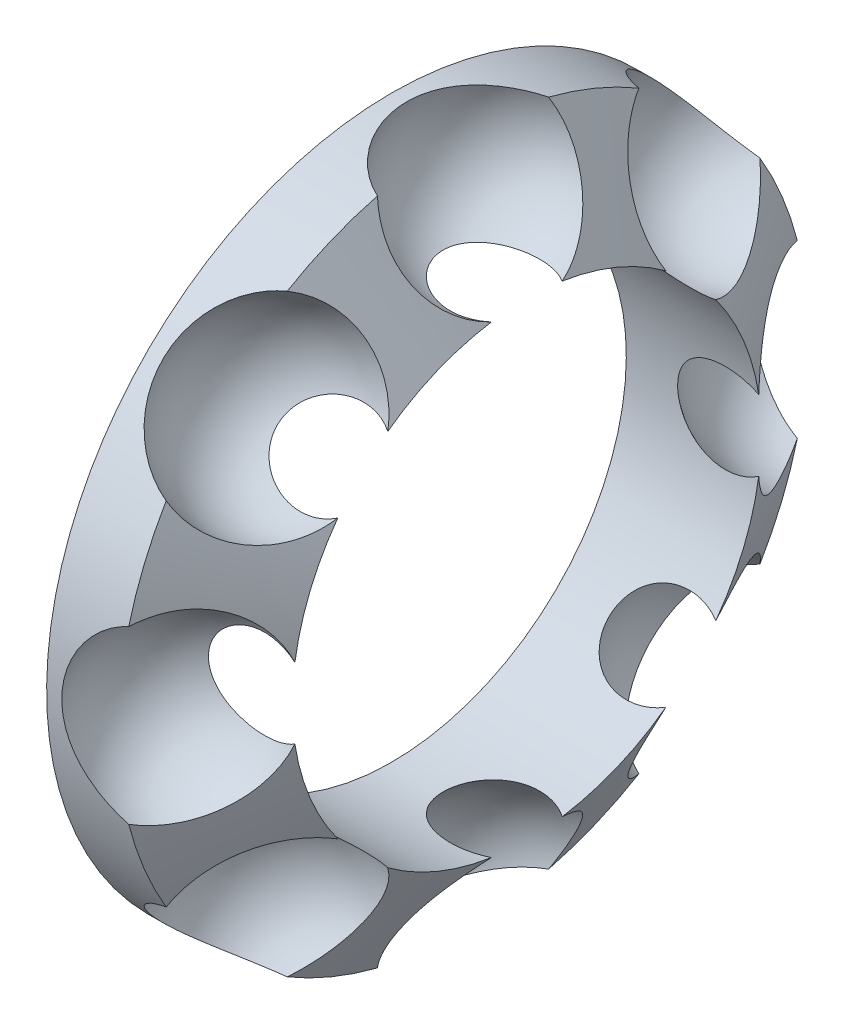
ISO-10303-21;
HEADER;
FILE_DESCRIPTION(('STEP AP214'),'2;1');
FILE_NAME('part.step','',(''),(''),'','','');
FILE_SCHEMA(('AUTOMOTIVE_DESIGN { 1 0 10303 214 1 1 1 1 }'));
ENDSEC;
DATA;
#1=APPLICATION_CONTEXT('core data for automotive mechanical design processes');
#2=APPLICATION_PROTOCOL_DEFINITION('international standard','automotive_design',2000,#1);
#3=PRODUCT_CONTEXT('',#1,'mechanical');
#4=PRODUCT('Part','Part','',(#3));
#5=PRODUCT_RELATED_PRODUCT_CATEGORY('part','',(#4));
#6=PRODUCT_DEFINITION_FORMATION('','',#4);
#7=PRODUCT_DEFINITION_CONTEXT('part definition',#1,'design');
#8=PRODUCT_DEFINITION('design','',#6,#7);
#9=PRODUCT_DEFINITION_SHAPE('','',#8);
#10=(LENGTH_UNIT() NAMED_UNIT(*) SI_UNIT(.MILLI.,.METRE.));
#11=(NAMED_UNIT(*) PLANE_ANGLE_UNIT() SI_UNIT($,.RADIAN.));
#12=(NAMED_UNIT(*) SI_UNIT($,.STERADIAN.) SOLID_ANGLE_UNIT());
#13=UNCERTAINTY_MEASURE_WITH_UNIT(LENGTH_MEASURE(1.E-05),#10,'distance_accuracy_value','');
#14=(GEOMETRIC_REPRESENTATION_CONTEXT(3) GLOBAL_UNCERTAINTY_ASSIGNED_CONTEXT((#13)) GLOBAL_UNIT_ASSIGNED_CONTEXT((#10,
#11,#12)) REPRESENTATION_CONTEXT('',''));
#15=CARTESIAN_POINT('',(0.,0.,0.));
#16=DIRECTION('',(0.,0.,1.));
#17=DIRECTION('',(1.,0.,0.));
#18=AXIS2_PLACEMENT_3D('',#15,#16,#17);
#19=CARTESIAN_POINT('',(1.2,9.266,0.));
#20=DIRECTION('',(-1.,0.,0.));
#21=DIRECTION('',(0.,0.,1.));
#22=AXIS2_PLACEMENT_3D('',#19,#20,#21);
#23=PLANE('',#22);
#24=CARTESIAN_POINT('',(1.2,0.,0.));
#25=DIRECTION('',(-1.,0.,0.));
#26=DIRECTION('',(0.,1.,0.));
#27=AXIS2_PLACEMENT_3D('',#24,#25,#26);
#28=CIRCLE('',#27,7.5);
#29=CARTESIAN_POINT('',(1.2,7.5,0.));
#30=VERTEX_POINT('',#29);
#31=EDGE_CURVE('E197',#30,#30,#28,.T.);
#32=ORIENTED_EDGE('',*,*,#31,.F.);
#33=EDGE_LOOP('',(#32));
#34=FACE_BOUND('',#33,.T.);
#35=CARTESIAN_POINT('',(1.2,0.,0.));
#36=DIRECTION('',(-1.,0.,0.));
#37=DIRECTION('',(0.,1.,0.));
#38=AXIS2_PLACEMENT_3D('',#35,#36,#37);
#39=CIRCLE('',#38,11.032);
#40=CARTESIAN_POINT('',(1.2,11.032,0.));
#41=VERTEX_POINT('',#40);
#42=EDGE_CURVE('E11',#41,#41,#39,.T.);
#43=ORIENTED_EDGE('',*,*,#42,.T.);
#44=EDGE_LOOP('',(#43));
#45=FACE_BOUND('',#44,.T.);
#46=ADVANCED_FACE('F17',(#34,#45),#23,.T.);
#47=DIRECTION('',(0.499999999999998,-0.86602540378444,0.));
#48=VECTOR('',#47,1.);
#49=CARTESIAN_POINT('',(4.5,9.266,0.));
#50=LINE('',#49,#48);
#51=CARTESIAN_POINT('',(9.84972759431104,0.,0.));
#52=DIRECTION('',(-1.,0.,0.));
#53=AXIS1_PLACEMENT('',#51,#52);
#54=SURFACE_OF_REVOLUTION('',#50,#53);
#55=CARTESIAN_POINT('',(5.51960057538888,0.,0.));
#56=DIRECTION('',(-1.,0.,0.));
#57=DIRECTION('',(0.,1.,0.));
#58=AXIS2_PLACEMENT_3D('',#55,#56,#57);
#59=CIRCLE('',#58,7.5);
#60=CARTESIAN_POINT('',(5.51960057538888,7.41447926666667,-1.12937912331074));
#61=VERTEX_POINT('',#60);
#62=CARTESIAN_POINT('',(5.51960057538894,6.04142020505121,-4.4442369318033));
#63=VERTEX_POINT('',#62);
#64=EDGE_CURVE('E243',#61,#63,#59,.T.);
#65=ORIENTED_EDGE('',*,*,#64,.T.);
#66=CARTESIAN_POINT('',(5.51960057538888,6.0414202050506,-4.44423693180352));
#67=CARTESIAN_POINT('',(5.49869385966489,6.11299486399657,-4.40805615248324));
#68=CARTESIAN_POINT('',(5.47581958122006,6.18542681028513,-4.37471835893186));
#69=CARTESIAN_POINT('',(5.42649852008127,6.33158935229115,-4.31396216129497));
#70=CARTESIAN_POINT('',(5.40005012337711,6.40532052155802,-4.28654644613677));
#71=CARTESIAN_POINT('',(5.34418740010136,6.55300683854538,-4.23809562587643));
#72=CARTESIAN_POINT('',(5.31479849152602,6.62695547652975,-4.21701123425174));
#73=CARTESIAN_POINT('',(5.253278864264,6.77519063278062,-4.18112326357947));
#74=CARTESIAN_POINT('',(5.22114987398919,6.84947691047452,-4.16631575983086));
#75=CARTESIAN_POINT('',(5.16579633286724,6.97286529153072,-4.14702270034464));
#76=CARTESIAN_POINT('',(5.14323091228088,7.02199623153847,-4.14074003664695));
#77=CARTESIAN_POINT('',(5.06174187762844,7.1955797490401,-4.12352928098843));
#78=CARTESIAN_POINT('',(5.00025523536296,7.31970951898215,-4.12030831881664));
#79=CARTESIAN_POINT('',(4.87300786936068,7.565040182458,-4.13235058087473));
#80=CARTESIAN_POINT('',(4.80723930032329,7.68623510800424,-4.14764869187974));
#81=CARTESIAN_POINT('',(4.65881994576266,7.94877646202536,-4.20182214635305));
#82=CARTESIAN_POINT('',(4.57555919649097,8.08891075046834,-4.24502858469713));
#83=CARTESIAN_POINT('',(4.40799109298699,8.35770664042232,-4.35733328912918));
#84=CARTESIAN_POINT('',(4.32368354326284,8.48636606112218,-4.42643646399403));
#85=CARTESIAN_POINT('',(4.15613285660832,8.72892945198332,-4.58879974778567));
#86=CARTESIAN_POINT('',(4.07289358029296,8.84278890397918,-4.68213031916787));
#87=CARTESIAN_POINT('',(3.90981475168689,9.05185702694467,-4.89012739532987));
#88=CARTESIAN_POINT('',(3.82997297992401,9.14707802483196,-5.00477970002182));
#89=CARTESIAN_POINT('',(3.70512742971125,9.28349907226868,-5.20448531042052));
#90=CARTESIAN_POINT('',(3.65850004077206,9.33141592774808,-5.28404036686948));
#91=CARTESIAN_POINT('',(3.56761713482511,9.41841364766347,-5.44891703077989));
#92=CARTESIAN_POINT('',(3.52335804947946,9.45750810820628,-5.53422949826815));
#93=CARTESIAN_POINT('',(3.48039942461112,9.49197165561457,-5.62205461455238));
#94=B_SPLINE_CURVE_WITH_KNOTS('',3,(#66,#67,#68,#69,#70,#71,#72,#73,#74,#75,#76,#77,#78,#79,#80,
#81,#82,#83,#84,#85,#86,#87,#88,#89,#90,#91,#92,#93),.UNSPECIFIED.,.F.,.F.,(4,2,2,2,2,2,2,2,2,2,
2,2,2,4),(0.,0.248558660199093,0.497229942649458,0.743912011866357,0.990439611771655,
1.15367385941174,1.56785681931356,1.98282124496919,2.4862510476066,2.98977632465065,
3.49478277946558,3.99945410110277,4.31069394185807,4.62145080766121),.UNSPECIFIED.);
#95=CARTESIAN_POINT('',(3.48039942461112,9.49197165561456,-5.62205461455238));
#96=VERTEX_POINT('',#95);
#97=EDGE_CURVE('E33',#63,#96,#94,.T.);
#98=ORIENTED_EDGE('',*,*,#97,.T.);
#99=CARTESIAN_POINT('',(3.48039942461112,0.,0.));
#100=DIRECTION('',(-1.,0.,0.));
#101=DIRECTION('',(0.,1.,0.));
#102=AXIS2_PLACEMENT_3D('',#99,#100,#101);
#103=CIRCLE('',#102,11.032);
#104=CARTESIAN_POINT('',(3.48039942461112,10.6872304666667,-2.73644458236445));
#105=VERTEX_POINT('',#104);
#106=EDGE_CURVE('E441',#105,#96,#103,.T.);
#107=ORIENTED_EDGE('',*,*,#106,.F.);
#108=CARTESIAN_POINT('',(3.48039942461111,10.6872304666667,-2.73644458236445));
#109=CARTESIAN_POINT('',(3.53549355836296,10.5763148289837,-2.78487259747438));
#110=CARTESIAN_POINT('',(3.59275324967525,10.4629103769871,-2.82495009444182));
#111=CARTESIAN_POINT('',(3.71095039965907,10.233124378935,-2.88802760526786));
#112=CARTESIAN_POINT('',(3.77189204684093,10.1167395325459,-2.91100775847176));
#113=CARTESIAN_POINT('',(3.91736586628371,9.84453224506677,-2.94410938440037));
#114=CARTESIAN_POINT('',(4.00301709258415,9.68843543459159,-2.947435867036));
#115=CARTESIAN_POINT('',(4.1771847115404,9.38035618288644,-2.92289477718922));
#116=CARTESIAN_POINT('',(4.26570162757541,9.22837450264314,-2.89502147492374));
#117=CARTESIAN_POINT('',(4.43856883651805,8.94086644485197,-2.81119833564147));
#118=CARTESIAN_POINT('',(4.52290451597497,8.80489683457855,-2.756732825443));
#119=CARTESIAN_POINT('',(4.68932890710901,8.54486576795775,-2.62204014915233));
#120=CARTESIAN_POINT('',(4.7714177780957,8.42080346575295,-2.54181481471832));
#121=CARTESIAN_POINT('',(4.93053076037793,8.18777526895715,-2.35772904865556));
#122=CARTESIAN_POINT('',(5.00755213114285,8.07881750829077,-2.253855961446));
#123=CARTESIAN_POINT('',(5.15331382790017,7.87872407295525,-2.02527013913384));
#124=CARTESIAN_POINT('',(5.22205823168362,7.787579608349,-1.90056773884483));
#125=CARTESIAN_POINT('',(5.33120216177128,7.64667508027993,-1.66921369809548));
#126=CARTESIAN_POINT('',(5.37428173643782,7.59235200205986,-1.56655815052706));
#127=CARTESIAN_POINT('',(5.45289364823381,7.49491341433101,-1.35345365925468));
#128=CARTESIAN_POINT('',(5.48843177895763,7.45178929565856,-1.24301078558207));
#129=CARTESIAN_POINT('',(5.51960057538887,7.41447926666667,-1.12937912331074));
#130=B_SPLINE_CURVE_WITH_KNOTS('',3,(#108,#109,#110,#111,#112,#113,#114,#115,#116,#117,#118,
#119,#120,#121,#122,#123,#124,#125,#126,#127,#128,#129),.UNSPECIFIED.,.F.,.F.,(4,2,2,2,2,2,2,2,
2,2,4),(0.,0.398510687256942,0.797483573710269,1.32881531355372,1.86024464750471,
2.36491632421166,2.8695521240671,3.37445862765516,3.87911535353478,4.24980388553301,
4.62020660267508),.UNSPECIFIED.);
#131=EDGE_CURVE('E211',#105,#61,#130,.T.);
#132=ORIENTED_EDGE('',*,*,#131,.T.);
#133=EDGE_LOOP('',(#65,#98,#107,#132));
#134=FACE_BOUND('',#133,.T.);
#135=ADVANCED_FACE('F216',(#134),#54,.F.);
#136=DIRECTION('',(0.499999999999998,-0.86602540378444,0.));
#137=VECTOR('',#136,1.);
#138=CARTESIAN_POINT('',(4.5,9.266,0.));
#139=LINE('',#138,#137);
#140=CARTESIAN_POINT('',(9.84972759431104,0.,0.));
#141=DIRECTION('',(-1.,0.,0.));
#142=AXIS1_PLACEMENT('',#140,#141);
#143=SURFACE_OF_REVOLUTION('',#139,#142);
#144=CARTESIAN_POINT('',(3.48039942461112,9.49197165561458,5.62205461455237));
#145=CARTESIAN_POINT('',(3.51946946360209,9.46063113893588,5.54217440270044));
#146=CARTESIAN_POINT('',(3.55963221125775,9.42543980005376,5.46434762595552));
#147=CARTESIAN_POINT('',(3.64188294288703,9.34777975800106,5.31348809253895));
#148=CARTESIAN_POINT('',(3.68397094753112,9.30531097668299,5.24045538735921));
#149=CARTESIAN_POINT('',(3.76970583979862,9.21363364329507,5.10004538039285));
#150=CARTESIAN_POINT('',(3.81334864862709,9.16444188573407,5.03265464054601));
#151=CARTESIAN_POINT('',(3.90197494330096,9.05976415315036,4.90397178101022));
#152=CARTESIAN_POINT('',(3.94695824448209,9.00427904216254,4.84267882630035));
#153=CARTESIAN_POINT('',(4.07377889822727,8.84158064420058,4.68113636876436));
#154=CARTESIAN_POINT('',(4.15681112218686,8.72796852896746,4.58810289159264));
#155=CARTESIAN_POINT('',(4.32416896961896,8.48564216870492,4.42600589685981));
#156=CARTESIAN_POINT('',(4.40849493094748,8.35692391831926,4.35694875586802));
#157=CARTESIAN_POINT('',(4.57637175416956,8.08758159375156,4.2445312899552));
#158=CARTESIAN_POINT('',(4.65991905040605,7.94691889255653,4.20125826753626));
#159=CARTESIAN_POINT('',(4.82312140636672,7.65805303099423,4.14201693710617));
#160=CARTESIAN_POINT('',(4.90278394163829,7.50986557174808,4.12599400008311));
#161=CARTESIAN_POINT('',(5.00325821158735,7.31209674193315,4.1229274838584));
#162=CARTESIAN_POINT('',(5.02721035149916,7.26407283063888,4.12358084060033));
#163=CARTESIAN_POINT('',(5.07432093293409,7.16775136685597,4.12765422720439));
#164=CARTESIAN_POINT('',(5.09747939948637,7.11945382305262,4.13107416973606));
#165=CARTESIAN_POINT('',(5.17869723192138,6.94644728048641,4.14823835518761));
#166=CARTESIAN_POINT('',(5.23425715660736,6.82123990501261,4.16975952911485));
#167=CARTESIAN_POINT('',(5.3375810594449,6.57183622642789,4.23057894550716));
#168=CARTESIAN_POINT('',(5.38534083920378,6.44764050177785,4.26988671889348));
#169=CARTESIAN_POINT('',(5.44503265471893,6.27721255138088,4.33617510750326));
#170=CARTESIAN_POINT('',(5.46106890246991,6.22956793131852,4.35608176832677));
#171=CARTESIAN_POINT('',(5.491543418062,6.13497354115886,4.39833966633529));
#172=CARTESIAN_POINT('',(5.50598467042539,6.08802262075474,4.42068617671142));
#173=CARTESIAN_POINT('',(5.51960057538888,6.0414202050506,4.44423693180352));
#174=B_SPLINE_CURVE_WITH_KNOTS('',3,(#144,#145,#146,#147,#148,#149,#150,#151,#152,#153,#154,
#155,#156,#157,#158,#159,#160,#161,#162,#163,#164,#165,#166,#167,#168,#169,#170,#171,#172,#173),
.UNSPECIFIED.,.F.,.F.,(4,2,2,2,2,2,2,2,2,2,2,2,2,2,4),(0.,0.282736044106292,0.56547512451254,
0.847520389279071,1.12952697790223,1.63303996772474,2.13668676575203,2.64202931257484,
3.14635758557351,3.30731335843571,3.46826405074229,3.88280040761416,4.29755915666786,
4.45969847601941,4.62152907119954),.UNSPECIFIED.);
#175=CARTESIAN_POINT('',(3.48039942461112,9.49197165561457,5.62205461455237));
#176=VERTEX_POINT('',#175);
#177=CARTESIAN_POINT('',(5.51960057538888,6.0414202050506,4.44423693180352));
#178=VERTEX_POINT('',#177);
#179=EDGE_CURVE('E268',#176,#178,#174,.T.);
#180=ORIENTED_EDGE('',*,*,#179,.T.);
#181=CARTESIAN_POINT('',(5.51960057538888,0.,0.));
#182=DIRECTION('',(-1.,0.,0.));
#183=DIRECTION('',(0.,1.,0.));
#184=AXIS2_PLACEMENT_3D('',#181,#182,#183);
#185=CIRCLE('',#184,7.5);
#186=CARTESIAN_POINT('',(5.51960057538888,7.41447926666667,1.12937912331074));
#187=VERTEX_POINT('',#186);
#188=EDGE_CURVE('E266',#178,#187,#185,.T.);
#189=ORIENTED_EDGE('',*,*,#188,.T.);
#190=CARTESIAN_POINT('',(5.51960057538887,7.41447926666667,1.12937912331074));
#191=CARTESIAN_POINT('',(5.49875700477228,7.4394313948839,1.20534068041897));
#192=CARTESIAN_POINT('',(5.47595994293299,7.46698085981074,1.27990396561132));
#193=CARTESIAN_POINT('',(5.42682915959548,7.52713436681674,1.42574037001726));
#194=CARTESIAN_POINT('',(5.40049599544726,7.55973761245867,1.49701400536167));
#195=CARTESIAN_POINT('',(5.34469143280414,7.6298227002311,1.63571497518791));
#196=CARTESIAN_POINT('',(5.31522399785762,7.66729839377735,1.70314700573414));
#197=CARTESIAN_POINT('',(5.25352330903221,7.74696279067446,1.83380527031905));
#198=CARTESIAN_POINT('',(5.22129000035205,7.78915158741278,1.897031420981));
#199=CARTESIAN_POINT('',(5.12084642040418,7.92272802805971,2.08009035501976));
#200=CARTESIAN_POINT('',(5.04899093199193,8.02100414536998,2.19306247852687));
#201=CARTESIAN_POINT('',(4.89881319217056,8.23355655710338,2.39750957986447));
#202=CARTESIAN_POINT('',(4.82048997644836,8.34783523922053,2.48898134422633));
#203=CARTESIAN_POINT('',(4.65901129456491,8.59147201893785,2.64933006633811));
#204=CARTESIAN_POINT('',(4.5758011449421,8.72102976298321,2.717849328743));
#205=CARTESIAN_POINT('',(4.4083513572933,8.99030489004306,2.828479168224));
#206=CARTESIAN_POINT('',(4.32411210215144,9.13001858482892,2.87059927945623));
#207=CARTESIAN_POINT('',(4.17114171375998,9.3913909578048,2.92248285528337));
#208=CARTESIAN_POINT('',(4.10220079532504,9.51209903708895,2.93651874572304));
#209=CARTESIAN_POINT('',(3.96641765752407,9.75531499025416,2.94530462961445));
#210=CARTESIAN_POINT('',(3.89957434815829,9.87782187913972,2.9400648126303));
#211=CARTESIAN_POINT('',(3.77195497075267,10.1166231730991,2.9110184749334));
#212=CARTESIAN_POINT('',(3.71104122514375,10.232946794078,2.88806693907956));
#213=CARTESIAN_POINT('',(3.62240629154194,10.4052626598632,2.84077942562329));
#214=CARTESIAN_POINT('',(3.59330170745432,10.4623711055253,2.82285988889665));
#215=CARTESIAN_POINT('',(3.53608667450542,10.5756020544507,2.78280009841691));
#216=CARTESIAN_POINT('',(3.50797628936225,10.6317244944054,2.76065957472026));
#217=CARTESIAN_POINT('',(3.48039942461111,10.6872304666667,2.73644458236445));
#218=B_SPLINE_CURVE_WITH_KNOTS('',3,(#190,#191,#192,#193,#194,#195,#196,#197,#198,#199,#200,
#201,#202,#203,#204,#205,#206,#207,#208,#209,#210,#211,#212,#213,#214,#215,#216,#217),
.UNSPECIFIED.,.F.,.F.,(4,2,2,2,2,2,2,2,2,2,2,2,2,4),(0.,0.24779277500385,0.495546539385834,
0.742990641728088,0.990439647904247,1.48618932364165,1.9820130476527,2.48523874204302,
2.98828258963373,3.40611348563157,3.82372353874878,4.22234654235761,4.42188197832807,
4.62143017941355),.UNSPECIFIED.);
#219=CARTESIAN_POINT('',(3.48039942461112,10.6872304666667,2.73644458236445));
#220=VERTEX_POINT('',#219);
#221=EDGE_CURVE('E259',#187,#220,#218,.T.);
#222=ORIENTED_EDGE('',*,*,#221,.T.);
#223=CARTESIAN_POINT('',(3.48039942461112,0.,0.));
#224=DIRECTION('',(-1.,0.,0.));
#225=DIRECTION('',(0.,1.,0.));
#226=AXIS2_PLACEMENT_3D('',#223,#224,#225);
#227=CIRCLE('',#226,11.032);
#228=EDGE_CURVE('E437',#176,#220,#227,.T.);
#229=ORIENTED_EDGE('',*,*,#228,.F.);
#230=EDGE_LOOP('',(#180,#189,#222,#229));
#231=FACE_BOUND('',#230,.T.);
#232=ADVANCED_FACE('F278',(#231),#143,.F.);
#233=DIRECTION('',(0.499999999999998,-0.86602540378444,0.));
#234=VECTOR('',#233,1.);
#235=CARTESIAN_POINT('',(4.5,9.266,0.));
#236=LINE('',#235,#234);
#237=CARTESIAN_POINT('',(9.84972759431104,0.,0.));
#238=DIRECTION('',(-1.,0.,0.));
#239=AXIS1_PLACEMENT('',#237,#238);
#240=SURFACE_OF_REVOLUTION('',#236,#239);
#241=CARTESIAN_POINT('',(5.51960057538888,1.12937912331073,-7.41447926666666));
#242=CARTESIAN_POINT('',(5.49878672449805,1.20523256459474,-7.43939577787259));
#243=CARTESIAN_POINT('',(5.4760248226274,1.27969181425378,-7.46690243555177));
#244=CARTESIAN_POINT('',(5.42697281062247,1.4253334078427,-7.52695747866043));
#245=CARTESIAN_POINT('',(5.40068309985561,1.4965161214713,-7.55950529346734));
#246=CARTESIAN_POINT('',(5.34489529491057,1.63524090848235,-7.62956402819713));
#247=CARTESIAN_POINT('',(5.31539229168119,1.70277716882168,-7.66708256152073));
#248=CARTESIAN_POINT('',(5.25361195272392,1.83363096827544,-7.74684687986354));
#249=CARTESIAN_POINT('',(5.22133467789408,1.89694859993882,-7.78909256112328));
#250=CARTESIAN_POINT('',(5.12074468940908,2.08027855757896,-7.92286253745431));
#251=CARTESIAN_POINT('',(5.04878284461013,2.19340078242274,-8.02128510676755));
#252=CARTESIAN_POINT('',(4.89855044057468,2.39781212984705,-8.23394201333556));
#253=CARTESIAN_POINT('',(4.82029926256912,2.48916512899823,-8.34812849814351));
#254=CARTESIAN_POINT('',(4.72038767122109,2.58838457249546,-8.49886682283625));
#255=CARTESIAN_POINT('',(4.70032058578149,2.60746215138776,-8.52938376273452));
#256=CARTESIAN_POINT('',(4.67008124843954,2.63495150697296,-8.57573662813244));
#257=CARTESIAN_POINT('',(4.65997916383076,2.64392611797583,-8.59128256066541));
#258=CARTESIAN_POINT('',(4.60933188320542,2.68788037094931,-8.66953101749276));
#259=CARTESIAN_POINT('',(4.56847275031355,2.7200144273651,-8.73364219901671));
#260=CARTESIAN_POINT('',(4.4440333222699,2.80789858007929,-8.93200176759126));
#261=CARTESIAN_POINT('',(4.35986039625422,2.85381777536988,-9.07038221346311));
#262=CARTESIAN_POINT('',(4.19232946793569,2.91832812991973,-9.3542454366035));
#263=CARTESIAN_POINT('',(4.10897402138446,2.93685085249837,-9.49974506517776));
#264=CARTESIAN_POINT('',(3.94534238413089,2.94582773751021,-9.79330716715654));
#265=CARTESIAN_POINT('',(3.86506626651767,2.93628123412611,-9.94136970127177));
#266=CARTESIAN_POINT('',(3.7095152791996,2.88926135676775,-10.2353678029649));
#267=CARTESIAN_POINT('',(3.63422875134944,2.8518557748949,-10.3813076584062));
#268=CARTESIAN_POINT('',(3.54834590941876,2.79131069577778,-10.5513549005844));
#269=CARTESIAN_POINT('',(3.53457564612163,2.78101944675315,-10.5787363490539));
#270=CARTESIAN_POINT('',(3.50729598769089,2.75946238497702,-10.6332019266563));
#271=CARTESIAN_POINT('',(3.4937863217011,2.74819765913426,-10.6602863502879));
#272=CARTESIAN_POINT('',(3.48039942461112,2.73644458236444,-10.6872304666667));
#273=B_SPLINE_CURVE_WITH_KNOTS('',3,(#241,#242,#243,#244,#245,#246,#247,#248,#249,#250,#251,
#252,#253,#254,#255,#256,#257,#258,#259,#260,#261,#262,#263,#264,#265,#266,#267,#268,#269,#270,
#271,#272),.UNSPECIFIED.,.F.,.F.,(4,2,2,2,2,2,2,2,2,2,2,2,2,2,2,4),(0.,0.24744055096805,
0.494853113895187,0.742649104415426,0.990439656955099,1.48696403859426,1.98201303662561,
2.10561154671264,2.16740092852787,2.41475616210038,2.91726098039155,3.42101895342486,
3.92478887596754,4.42733691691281,4.52432181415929,4.62119979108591),.UNSPECIFIED.);
#274=CARTESIAN_POINT('',(5.51960057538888,1.12937912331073,-7.41447926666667));
#275=VERTEX_POINT('',#274);
#276=CARTESIAN_POINT('',(3.48039942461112,2.73644458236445,-10.6872304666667));
#277=VERTEX_POINT('',#276);
#278=EDGE_CURVE('E267',#275,#277,#273,.T.);
#279=ORIENTED_EDGE('',*,*,#278,.T.);
#280=CARTESIAN_POINT('',(3.48039942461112,0.,0.));
#281=DIRECTION('',(-1.,0.,0.));
#282=DIRECTION('',(0.,1.,0.));
#283=AXIS2_PLACEMENT_3D('',#280,#281,#282);
#284=CIRCLE('',#283,11.032);
#285=CARTESIAN_POINT('',(3.48039942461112,5.62205461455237,-9.49197165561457));
#286=VERTEX_POINT('',#285);
#287=EDGE_CURVE('E426',#286,#277,#284,.T.);
#288=ORIENTED_EDGE('',*,*,#287,.F.);
#289=CARTESIAN_POINT('',(3.48039942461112,5.62205461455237,-9.49197165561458));
#290=CARTESIAN_POINT('',(3.51949914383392,5.54211214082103,-9.46060810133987));
#291=CARTESIAN_POINT('',(3.55969536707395,5.46422452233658,-9.42538479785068));
#292=CARTESIAN_POINT('',(3.64203619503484,5.31321427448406,-9.34763042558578));
#293=CARTESIAN_POINT('',(3.68418177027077,5.2400940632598,-9.30509568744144));
#294=CARTESIAN_POINT('',(3.76994260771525,5.09967371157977,-9.21337029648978));
#295=CARTESIAN_POINT('',(3.81355036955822,5.0323487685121,-9.16421058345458));
#296=CARTESIAN_POINT('',(3.90209678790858,4.90380789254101,-9.05961326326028));
#297=CARTESIAN_POINT('',(3.94703455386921,4.8425879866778,-9.00417978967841));
#298=CARTESIAN_POINT('',(4.03260033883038,4.73358345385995,-8.89440987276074));
#299=CARTESIAN_POINT('',(4.07311436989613,4.68506539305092,-8.84070978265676));
#300=CARTESIAN_POINT('',(4.1546809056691,4.59356907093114,-8.7292613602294));
#301=CARTESIAN_POINT('',(4.19573282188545,4.55058523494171,-8.67151719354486));
#302=CARTESIAN_POINT('',(4.25746152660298,4.49053744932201,-8.58227278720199));
#303=CARTESIAN_POINT('',(4.2780257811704,4.47129017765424,-8.55214315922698));
#304=CARTESIAN_POINT('',(4.308904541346,4.44352253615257,-8.50630760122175));
#305=CARTESIAN_POINT('',(4.31920203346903,4.43445121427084,-8.49092348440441));
#306=CARTESIAN_POINT('',(4.3346534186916,4.42112283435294,-8.46769169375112));
#307=CARTESIAN_POINT('',(4.33980463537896,4.41672655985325,-8.45992198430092));
#308=CARTESIAN_POINT('',(4.36556753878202,4.39497471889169,-8.42094004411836));
#309=CARTESIAN_POINT('',(4.38618734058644,4.37831847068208,-8.38934615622));
#310=CARTESIAN_POINT('',(4.48955724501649,4.29861841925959,-8.22898695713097));
#311=CARTESIAN_POINT('',(4.57231978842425,4.24701376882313,-8.09425296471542));
#312=CARTESIAN_POINT('',(4.73621624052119,4.16931085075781,-7.81420651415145));
#313=CARTESIAN_POINT('',(4.81731276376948,4.14356851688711,-7.66877523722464));
#314=CARTESIAN_POINT('',(4.97401141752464,4.11932521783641,-7.3724270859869));
#315=CARTESIAN_POINT('',(5.04960353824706,4.12087269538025,-7.22150093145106));
#316=CARTESIAN_POINT('',(5.1920460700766,4.1511437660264,-6.91794752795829));
#317=CARTESIAN_POINT('',(5.2588869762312,4.17989663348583,-6.76531862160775));
#318=CARTESIAN_POINT('',(5.34987236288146,4.24244447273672,-6.53843491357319));
#319=CARTESIAN_POINT('',(5.37863711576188,4.26650541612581,-6.46320473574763));
#320=CARTESIAN_POINT('',(5.4327276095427,4.32087315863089,-6.31378182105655));
#321=CARTESIAN_POINT('',(5.4580549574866,4.35117702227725,-6.23958861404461));
#322=CARTESIAN_POINT('',(5.49481381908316,4.40342829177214,-6.12431426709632));
#323=CARTESIAN_POINT('',(5.50753580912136,4.4233619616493,-6.08271990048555));
#324=CARTESIAN_POINT('',(5.51960057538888,4.44423693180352,-6.0414202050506));
#325=B_SPLINE_CURVE_WITH_KNOTS('',3,(#289,#290,#291,#292,#293,#294,#295,#296,#297,#298,#299,
#300,#301,#302,#303,#304,#305,#306,#307,#308,#309,#310,#311,#312,#313,#314,#315,#316,#317,#318,
#319,#320,#321,#322,#323,#324),.UNSPECIFIED.,.F.,.F.,(4,2,2,2,2,2,2,2,2,2,2,2,2,2,2,2,2,4),(0.,
0.282960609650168,0.566063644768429,0.847887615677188,1.12952697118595,1.37807545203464,
1.62637157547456,1.75007547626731,1.81191754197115,1.8428373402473,1.96654123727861,
2.46295723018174,2.96611529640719,3.470166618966,3.97476094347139,4.22668865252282,
4.47849817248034,4.62197516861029),.UNSPECIFIED.);
#326=CARTESIAN_POINT('',(5.51960057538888,4.44423693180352,-6.0414202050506));
#327=VERTEX_POINT('',#326);
#328=EDGE_CURVE('E433',#286,#327,#325,.T.);
#329=ORIENTED_EDGE('',*,*,#328,.T.);
#330=CARTESIAN_POINT('',(5.51960057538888,0.,0.));
#331=DIRECTION('',(-1.,0.,0.));
#332=DIRECTION('',(0.,1.,0.));
#333=AXIS2_PLACEMENT_3D('',#330,#331,#332);
#334=CIRCLE('',#333,7.5);
#335=EDGE_CURVE('E429',#327,#275,#334,.T.);
#336=ORIENTED_EDGE('',*,*,#335,.T.);
#337=EDGE_LOOP('',(#279,#288,#329,#336));
#338=FACE_BOUND('',#337,.T.);
#339=ADVANCED_FACE('F282',(#338),#240,.F.);
#340=DIRECTION('',(0.499999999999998,-0.86602540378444,0.));
#341=VECTOR('',#340,1.);
#342=CARTESIAN_POINT('',(4.5,9.266,0.));
#343=LINE('',#342,#341);
#344=CARTESIAN_POINT('',(9.84972759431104,0.,0.));
#345=DIRECTION('',(-1.,0.,0.));
#346=AXIS1_PLACEMENT('',#344,#345);
#347=SURFACE_OF_REVOLUTION('',#343,#346);
#348=CARTESIAN_POINT('',(5.51960057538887,-4.44423693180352,-6.0414202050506));
#349=CARTESIAN_POINT('',(5.4942013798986,-4.40028680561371,-6.12837319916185));
#350=CARTESIAN_POINT('',(5.46591484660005,-4.36054549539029,-6.21654492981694));
#351=CARTESIAN_POINT('',(5.40416716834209,-4.28984591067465,-6.39472861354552));
#352=CARTESIAN_POINT('',(5.37069939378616,-4.25889903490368,-6.48474279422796));
#353=CARTESIAN_POINT('',(5.27589670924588,-4.18905924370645,-6.72498756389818));
#354=CARTESIAN_POINT('',(5.21065145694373,-4.15820621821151,-6.87609895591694));
#355=CARTESIAN_POINT('',(5.07111785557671,-4.12311081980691,-7.17730668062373));
#356=CARTESIAN_POINT('',(4.99682173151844,-4.11889149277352,-7.327402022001));
#357=CARTESIAN_POINT('',(4.84218354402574,-4.13744985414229,-7.62312455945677));
#358=CARTESIAN_POINT('',(4.76182983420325,-4.16028085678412,-7.7687423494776));
#359=CARTESIAN_POINT('',(4.59812246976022,-4.23252882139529,-8.05139372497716));
#360=CARTESIAN_POINT('',(4.51476956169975,-4.28193920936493,-8.18842942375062));
#361=CARTESIAN_POINT('',(4.34706463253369,-4.40640708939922,-8.45112359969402));
#362=CARTESIAN_POINT('',(4.26270966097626,-4.48163459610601,-8.57669948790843));
#363=CARTESIAN_POINT('',(4.0957815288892,-4.65560634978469,-8.81189508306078));
#364=CARTESIAN_POINT('',(4.01320869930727,-4.75435492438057,-8.92151184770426));
#365=CARTESIAN_POINT('',(3.8925033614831,-4.91747919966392,-9.07108120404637));
#366=CARTESIAN_POINT('',(3.85287530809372,-4.97421694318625,-9.11837629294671));
#367=CARTESIAN_POINT('',(3.77476455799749,-5.09236643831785,-9.20783647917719));
#368=CARTESIAN_POINT('',(3.73628186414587,-5.15377820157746,-9.25000156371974));
#369=CARTESIAN_POINT('',(3.66065028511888,-5.28086062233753,-9.328871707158));
#370=CARTESIAN_POINT('',(3.6235024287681,-5.34653445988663,-9.36557262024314));
#371=CARTESIAN_POINT('',(3.55074863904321,-5.4816165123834,-9.43318694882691));
#372=CARTESIAN_POINT('',(3.51514281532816,-5.5510249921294,-9.46409995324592));
#373=CARTESIAN_POINT('',(3.48039942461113,-5.62205461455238,-9.49197165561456));
#374=B_SPLINE_CURVE_WITH_KNOTS('',3,(#348,#349,#350,#351,#352,#353,#354,#355,#356,#357,#358,
#359,#360,#361,#362,#363,#364,#365,#366,#367,#368,#369,#370,#371,#372,#373),.UNSPECIFIED.,.F.,
.F.,(4,2,2,2,2,2,2,2,2,2,2,2,4),(0.,0.301815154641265,0.604019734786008,1.10386728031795,
1.60414727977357,2.10541493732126,2.60655867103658,3.11106803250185,3.61567029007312,
3.86689909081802,4.1181285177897,4.36954759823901,4.62098452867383),.UNSPECIFIED.);
#375=CARTESIAN_POINT('',(5.51960057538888,-4.44423693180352,-6.0414202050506));
#376=VERTEX_POINT('',#375);
#377=CARTESIAN_POINT('',(3.48039942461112,-5.62205461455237,-9.49197165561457));
#378=VERTEX_POINT('',#377);
#379=EDGE_CURVE('E306',#376,#378,#374,.T.);
#380=ORIENTED_EDGE('',*,*,#379,.T.);
#381=CARTESIAN_POINT('',(3.48039942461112,0.,0.));
#382=DIRECTION('',(-1.,0.,0.));
#383=DIRECTION('',(0.,1.,0.));
#384=AXIS2_PLACEMENT_3D('',#381,#382,#383);
#385=CIRCLE('',#384,11.032);
#386=CARTESIAN_POINT('',(3.48039942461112,-2.73644458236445,-10.6872304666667));
#387=VERTEX_POINT('',#386);
#388=EDGE_CURVE('E419',#387,#378,#385,.T.);
#389=ORIENTED_EDGE('',*,*,#388,.F.);
#390=CARTESIAN_POINT('',(3.48039942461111,-2.73644458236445,-10.6872304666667));
#391=CARTESIAN_POINT('',(3.51946136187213,-2.77076017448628,-10.6086018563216));
#392=CARTESIAN_POINT('',(3.55961552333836,-2.80090259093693,-10.5287028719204));
#393=CARTESIAN_POINT('',(3.64184829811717,-2.85265523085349,-10.3671495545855));
#394=CARTESIAN_POINT('',(3.68392693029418,-2.87426537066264,-10.2854952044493));
#395=CARTESIAN_POINT('',(3.76966038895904,-2.90873176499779,-10.1213855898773));
#396=CARTESIAN_POINT('',(3.81331182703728,-2.92160577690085,-10.0389322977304));
#397=CARTESIAN_POINT('',(3.90195599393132,-2.93858728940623,-9.87388713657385));
#398=CARTESIAN_POINT('',(3.9469485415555,-2.94269596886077,-9.79129528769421));
#399=CARTESIAN_POINT('',(4.07380585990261,-2.94187787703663,-9.56195626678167));
#400=CARTESIAN_POINT('',(4.15686691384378,-2.92731592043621,-9.41578671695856));
#401=CARTESIAN_POINT('',(4.32422351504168,-2.87057006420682,-9.12982305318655));
#402=CARTESIAN_POINT('',(4.40851856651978,-2.82839697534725,-8.9900264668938));
#403=CARTESIAN_POINT('',(4.5762727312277,-2.71750933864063,-8.72028098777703));
#404=CARTESIAN_POINT('',(4.65972926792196,-2.64872954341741,-8.59035725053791));
#405=CARTESIAN_POINT('',(4.82290989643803,-2.48646453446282,-8.34421598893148));
#406=CARTESIAN_POINT('',(4.90263232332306,-2.3929684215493,-8.22800454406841));
#407=CARTESIAN_POINT('',(5.05525335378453,-2.18383449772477,-8.01229732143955));
#408=CARTESIAN_POINT('',(5.1281532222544,-2.0682008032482,-7.91279844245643));
#409=CARTESIAN_POINT('',(5.26382318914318,-1.81790753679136,-7.73282860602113));
#410=CARTESIAN_POINT('',(5.32660624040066,-1.68327271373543,-7.65233325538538));
#411=CARTESIAN_POINT('',(5.40855369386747,-1.47540708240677,-7.54974150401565));
#412=CARTESIAN_POINT('',(5.4330133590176,-1.40810803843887,-7.51952464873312));
#413=CARTESIAN_POINT('',(5.47874752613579,-1.27074840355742,-7.46361392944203));
#414=CARTESIAN_POINT('',(5.50002703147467,-1.20069237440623,-7.43791294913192));
#415=CARTESIAN_POINT('',(5.51960057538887,-1.12937912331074,-7.41447926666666));
#416=B_SPLINE_CURVE_WITH_KNOTS('',3,(#390,#391,#392,#393,#394,#395,#396,#397,#398,#399,#400,
#401,#402,#403,#404,#405,#406,#407,#408,#409,#410,#411,#412,#413,#414,#415),.UNSPECIFIED.,.F.,
.F.,(4,2,2,2,2,2,2,2,2,2,2,2,4),(0.,0.282677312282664,0.565357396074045,0.847461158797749,
1.12952697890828,1.63320541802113,2.13668676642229,2.64141070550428,3.14635758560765,
3.65121066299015,4.15541213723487,4.38836601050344,4.62094942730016),.UNSPECIFIED.);
#417=CARTESIAN_POINT('',(5.51960057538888,-1.12937912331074,-7.41447926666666));
#418=VERTEX_POINT('',#417);
#419=EDGE_CURVE('E311',#387,#418,#416,.T.);
#420=ORIENTED_EDGE('',*,*,#419,.T.);
#421=CARTESIAN_POINT('',(5.51960057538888,0.,0.));
#422=DIRECTION('',(-1.,0.,0.));
#423=DIRECTION('',(0.,1.,0.));
#424=AXIS2_PLACEMENT_3D('',#421,#422,#423);
#425=CIRCLE('',#424,7.5);
#426=EDGE_CURVE('E318',#418,#376,#425,.T.);
#427=ORIENTED_EDGE('',*,*,#426,.T.);
#428=EDGE_LOOP('',(#380,#389,#420,#427));
#429=FACE_BOUND('',#428,.T.);
#430=ADVANCED_FACE('F296',(#429),#347,.F.);
#431=DIRECTION('',(0.499999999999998,-0.86602540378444,0.));
#432=VECTOR('',#431,1.);
#433=CARTESIAN_POINT('',(4.5,9.266,0.));
#434=LINE('',#433,#432);
#435=CARTESIAN_POINT('',(9.84972759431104,0.,0.));
#436=DIRECTION('',(-1.,0.,0.));
#437=AXIS1_PLACEMENT('',#435,#436);
#438=SURFACE_OF_REVOLUTION('',#434,#437);
#439=CARTESIAN_POINT('',(5.51960057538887,-7.41447926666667,-1.12937912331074));
#440=CARTESIAN_POINT('',(5.49875700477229,-7.4394313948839,-1.20534068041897));
#441=CARTESIAN_POINT('',(5.47595994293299,-7.46698085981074,-1.27990396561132));
#442=CARTESIAN_POINT('',(5.42682915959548,-7.52713436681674,-1.42574037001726));
#443=CARTESIAN_POINT('',(5.40049599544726,-7.55973761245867,-1.49701400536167));
#444=CARTESIAN_POINT('',(5.34469143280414,-7.6298227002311,-1.63571497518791));
#445=CARTESIAN_POINT('',(5.31522399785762,-7.66729839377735,-1.70314700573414));
#446=CARTESIAN_POINT('',(5.25352330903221,-7.74696279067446,-1.83380527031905));
#447=CARTESIAN_POINT('',(5.22129000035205,-7.78915158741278,-1.897031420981));
#448=CARTESIAN_POINT('',(5.12084642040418,-7.92272802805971,-2.08009035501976));
#449=CARTESIAN_POINT('',(5.04899093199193,-8.02100414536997,-2.19306247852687));
#450=CARTESIAN_POINT('',(4.89881319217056,-8.23355655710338,-2.39750957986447));
#451=CARTESIAN_POINT('',(4.82048997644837,-8.34783523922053,-2.48898134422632));
#452=CARTESIAN_POINT('',(4.65901129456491,-8.59147201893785,-2.64933006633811));
#453=CARTESIAN_POINT('',(4.5758011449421,-8.72102976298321,-2.717849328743));
#454=CARTESIAN_POINT('',(4.4083513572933,-8.99030489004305,-2.828479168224));
#455=CARTESIAN_POINT('',(4.32411210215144,-9.13001858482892,-2.87059927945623));
#456=CARTESIAN_POINT('',(4.17114171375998,-9.3913909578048,-2.92248285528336));
#457=CARTESIAN_POINT('',(4.10220079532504,-9.51209903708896,-2.93651874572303));
#458=CARTESIAN_POINT('',(3.96641765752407,-9.75531499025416,-2.94530462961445));
#459=CARTESIAN_POINT('',(3.89957434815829,-9.87782187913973,-2.9400648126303));
#460=CARTESIAN_POINT('',(3.77195497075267,-10.1166231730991,-2.9110184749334));
#461=CARTESIAN_POINT('',(3.71104122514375,-10.232946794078,-2.88806693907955));
#462=CARTESIAN_POINT('',(3.62240629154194,-10.4052626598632,-2.84077942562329));
#463=CARTESIAN_POINT('',(3.59330170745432,-10.4623711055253,-2.82285988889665));
#464=CARTESIAN_POINT('',(3.53608667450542,-10.5756020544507,-2.78280009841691));
#465=CARTESIAN_POINT('',(3.50797628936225,-10.6317244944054,-2.76065957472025));
#466=CARTESIAN_POINT('',(3.48039942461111,-10.6872304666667,-2.73644458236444));
#467=B_SPLINE_CURVE_WITH_KNOTS('',3,(#439,#440,#441,#442,#443,#444,#445,#446,#447,#448,#449,
#450,#451,#452,#453,#454,#455,#456,#457,#458,#459,#460,#461,#462,#463,#464,#465,#466),
.UNSPECIFIED.,.F.,.F.,(4,2,2,2,2,2,2,2,2,2,2,2,2,4),(0.,0.247792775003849,0.495546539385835,
0.742990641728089,0.990439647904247,1.48618932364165,1.9820130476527,2.48523874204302,
2.98828258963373,3.40611348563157,3.82372353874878,4.22234654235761,4.42188197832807,
4.62143017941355),.UNSPECIFIED.);
#468=CARTESIAN_POINT('',(5.51960057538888,-7.41447926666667,-1.12937912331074));
#469=VERTEX_POINT('',#468);
#470=CARTESIAN_POINT('',(3.48039942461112,-10.6872304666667,-2.73644458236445));
#471=VERTEX_POINT('',#470);
#472=EDGE_CURVE('E155',#469,#471,#467,.T.);
#473=ORIENTED_EDGE('',*,*,#472,.T.);
#474=CARTESIAN_POINT('',(3.48039942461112,0.,0.));
#475=DIRECTION('',(-1.,0.,0.));
#476=DIRECTION('',(0.,1.,0.));
#477=AXIS2_PLACEMENT_3D('',#474,#475,#476);
#478=CIRCLE('',#477,11.032);
#479=CARTESIAN_POINT('',(3.48039942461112,-9.49197165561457,-5.62205461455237));
#480=VERTEX_POINT('',#479);
#481=EDGE_CURVE('E176',#480,#471,#478,.T.);
#482=ORIENTED_EDGE('',*,*,#481,.F.);
#483=CARTESIAN_POINT('',(3.48039942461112,-9.49197165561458,-5.62205461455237));
#484=CARTESIAN_POINT('',(3.51946946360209,-9.46063113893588,-5.54217440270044));
#485=CARTESIAN_POINT('',(3.55963221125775,-9.42543980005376,-5.46434762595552));
#486=CARTESIAN_POINT('',(3.64188294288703,-9.34777975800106,-5.31348809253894));
#487=CARTESIAN_POINT('',(3.68397094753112,-9.30531097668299,-5.24045538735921));
#488=CARTESIAN_POINT('',(3.76970583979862,-9.21363364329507,-5.10004538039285));
#489=CARTESIAN_POINT('',(3.81334864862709,-9.16444188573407,-5.03265464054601));
#490=CARTESIAN_POINT('',(3.90197494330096,-9.05976415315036,-4.90397178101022));
#491=CARTESIAN_POINT('',(3.9469582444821,-9.00427904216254,-4.84267882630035));
#492=CARTESIAN_POINT('',(4.07377889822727,-8.84158064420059,-4.68113636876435));
#493=CARTESIAN_POINT('',(4.15681112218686,-8.72796852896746,-4.58810289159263));
#494=CARTESIAN_POINT('',(4.32416896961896,-8.48564216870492,-4.42600589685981));
#495=CARTESIAN_POINT('',(4.40849493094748,-8.35692391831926,-4.35694875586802));
#496=CARTESIAN_POINT('',(4.57637175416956,-8.08758159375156,-4.24453128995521));
#497=CARTESIAN_POINT('',(4.65991905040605,-7.94691889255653,-4.20125826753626));
#498=CARTESIAN_POINT('',(4.82312140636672,-7.65805303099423,-4.14201693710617));
#499=CARTESIAN_POINT('',(4.90278394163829,-7.50986557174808,-4.1259940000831));
#500=CARTESIAN_POINT('',(5.00325821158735,-7.31209674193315,-4.1229274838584));
#501=CARTESIAN_POINT('',(5.02721035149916,-7.26407283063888,-4.12358084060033));
#502=CARTESIAN_POINT('',(5.07432093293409,-7.16775136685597,-4.12765422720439));
#503=CARTESIAN_POINT('',(5.09747939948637,-7.11945382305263,-4.13107416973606));
#504=CARTESIAN_POINT('',(5.17869723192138,-6.94644728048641,-4.14823835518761));
#505=CARTESIAN_POINT('',(5.23425715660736,-6.82123990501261,-4.16975952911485));
#506=CARTESIAN_POINT('',(5.3375810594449,-6.5718362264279,-4.23057894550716));
#507=CARTESIAN_POINT('',(5.38534083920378,-6.44764050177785,-4.26988671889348));
#508=CARTESIAN_POINT('',(5.44503265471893,-6.27721255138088,-4.33617510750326));
#509=CARTESIAN_POINT('',(5.46106890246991,-6.22956793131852,-4.35608176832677));
#510=CARTESIAN_POINT('',(5.491543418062,-6.13497354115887,-4.39833966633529));
#511=CARTESIAN_POINT('',(5.50598467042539,-6.08802262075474,-4.42068617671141));
#512=CARTESIAN_POINT('',(5.51960057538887,-6.04142020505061,-4.44423693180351));
#513=B_SPLINE_CURVE_WITH_KNOTS('',3,(#483,#484,#485,#486,#487,#488,#489,#490,#491,#492,#493,
#494,#495,#496,#497,#498,#499,#500,#501,#502,#503,#504,#505,#506,#507,#508,#509,#510,#511,#512),
.UNSPECIFIED.,.F.,.F.,(4,2,2,2,2,2,2,2,2,2,2,2,2,2,4),(0.,0.282736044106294,0.565475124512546,
0.847520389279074,1.12952697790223,1.63303996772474,2.13668676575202,2.64202931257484,
3.14635758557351,3.30731335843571,3.46826405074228,3.88280040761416,4.29755915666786,
4.4596984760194,4.62152907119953),.UNSPECIFIED.);
#514=CARTESIAN_POINT('',(5.51960057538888,-6.04142020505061,-4.44423693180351));
#515=VERTEX_POINT('',#514);
#516=EDGE_CURVE('E324',#480,#515,#513,.T.);
#517=ORIENTED_EDGE('',*,*,#516,.T.);
#518=CARTESIAN_POINT('',(5.51960057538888,0.,0.));
#519=DIRECTION('',(-1.,0.,0.));
#520=DIRECTION('',(0.,1.,0.));
#521=AXIS2_PLACEMENT_3D('',#518,#519,#520);
#522=CIRCLE('',#521,7.5);
#523=EDGE_CURVE('E409',#515,#469,#522,.T.);
#524=ORIENTED_EDGE('',*,*,#523,.T.);
#525=EDGE_LOOP('',(#473,#482,#517,#524));
#526=FACE_BOUND('',#525,.T.);
#527=ADVANCED_FACE('F300',(#526),#438,.F.);
#528=DIRECTION('',(0.499999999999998,-0.86602540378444,0.));
#529=VECTOR('',#528,1.);
#530=CARTESIAN_POINT('',(4.5,9.266,0.));
#531=LINE('',#530,#529);
#532=CARTESIAN_POINT('',(9.84972759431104,0.,0.));
#533=DIRECTION('',(-1.,0.,0.));
#534=AXIS1_PLACEMENT('',#532,#533);
#535=SURFACE_OF_REVOLUTION('',#531,#534);
#536=CARTESIAN_POINT('',(5.51960057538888,0.,0.));
#537=DIRECTION('',(-1.,0.,0.));
#538=DIRECTION('',(0.,1.,0.));
#539=AXIS2_PLACEMENT_3D('',#536,#537,#538);
#540=CIRCLE('',#539,7.5);
#541=CARTESIAN_POINT('',(5.51960057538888,-7.41447926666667,1.12937912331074));
#542=VERTEX_POINT('',#541);
#543=CARTESIAN_POINT('',(5.51960057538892,-6.04142020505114,4.44423693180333));
#544=VERTEX_POINT('',#543);
#545=EDGE_CURVE('E147',#542,#544,#540,.T.);
#546=ORIENTED_EDGE('',*,*,#545,.T.);
#547=CARTESIAN_POINT('',(5.51960057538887,-6.0414202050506,4.44423693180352));
#548=CARTESIAN_POINT('',(5.49869385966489,-6.11299486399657,4.40805615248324));
#549=CARTESIAN_POINT('',(5.47581958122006,-6.18542681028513,4.37471835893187));
#550=CARTESIAN_POINT('',(5.42649852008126,-6.33158935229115,4.31396216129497));
#551=CARTESIAN_POINT('',(5.40005012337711,-6.40532052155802,4.28654644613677));
#552=CARTESIAN_POINT('',(5.34418740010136,-6.55300683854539,4.23809562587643));
#553=CARTESIAN_POINT('',(5.31479849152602,-6.62695547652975,4.21701123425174));
#554=CARTESIAN_POINT('',(5.253278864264,-6.77519063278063,4.18112326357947));
#555=CARTESIAN_POINT('',(5.22114987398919,-6.84947691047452,4.16631575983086));
#556=CARTESIAN_POINT('',(5.16579633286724,-6.97286529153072,4.14702270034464));
#557=CARTESIAN_POINT('',(5.14323091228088,-7.02199623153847,4.14074003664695));
#558=CARTESIAN_POINT('',(5.06174187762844,-7.1955797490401,4.12352928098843));
#559=CARTESIAN_POINT('',(5.00025523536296,-7.31970951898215,4.12030831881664));
#560=CARTESIAN_POINT('',(4.87300786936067,-7.565040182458,4.13235058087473));
#561=CARTESIAN_POINT('',(4.80723930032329,-7.68623510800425,4.14764869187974));
#562=CARTESIAN_POINT('',(4.65881994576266,-7.94877646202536,4.20182214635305));
#563=CARTESIAN_POINT('',(4.57555919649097,-8.08891075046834,4.24502858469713));
#564=CARTESIAN_POINT('',(4.40799109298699,-8.35770664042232,4.35733328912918));
#565=CARTESIAN_POINT('',(4.32368354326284,-8.48636606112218,4.42643646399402));
#566=CARTESIAN_POINT('',(4.15613285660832,-8.72892945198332,4.58879974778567));
#567=CARTESIAN_POINT('',(4.07289358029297,-8.84278890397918,4.68213031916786));
#568=CARTESIAN_POINT('',(3.90981475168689,-9.05185702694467,4.89012739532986));
#569=CARTESIAN_POINT('',(3.829972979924,-9.14707802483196,5.00477970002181));
#570=CARTESIAN_POINT('',(3.70512742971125,-9.28349907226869,5.20448531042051));
#571=CARTESIAN_POINT('',(3.65850004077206,-9.33141592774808,5.28404036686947));
#572=CARTESIAN_POINT('',(3.56761713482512,-9.41841364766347,5.44891703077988));
#573=CARTESIAN_POINT('',(3.52335804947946,-9.45750810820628,5.53422949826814));
#574=CARTESIAN_POINT('',(3.48039942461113,-9.49197165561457,5.62205461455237));
#575=B_SPLINE_CURVE_WITH_KNOTS('',3,(#547,#548,#549,#550,#551,#552,#553,#554,#555,#556,#557,
#558,#559,#560,#561,#562,#563,#564,#565,#566,#567,#568,#569,#570,#571,#572,#573,#574),
.UNSPECIFIED.,.F.,.F.,(4,2,2,2,2,2,2,2,2,2,2,2,2,4),(0.,0.248558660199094,0.49722994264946,
0.743912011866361,0.990439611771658,1.15367385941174,1.56785681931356,1.98282124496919,
2.4862510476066,2.98977632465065,3.49478277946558,3.99945410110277,4.31069394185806,
4.62145080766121),.UNSPECIFIED.);
#576=CARTESIAN_POINT('',(3.48039942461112,-9.49197165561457,5.62205461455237));
#577=VERTEX_POINT('',#576);
#578=EDGE_CURVE('E136',#544,#577,#575,.T.);
#579=ORIENTED_EDGE('',*,*,#578,.T.);
#580=CARTESIAN_POINT('',(3.48039942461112,0.,0.));
#581=DIRECTION('',(-1.,0.,0.));
#582=DIRECTION('',(0.,1.,0.));
#583=AXIS2_PLACEMENT_3D('',#580,#581,#582);
#584=CIRCLE('',#583,11.032);
#585=CARTESIAN_POINT('',(3.48039942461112,-10.6872304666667,2.73644458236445));
#586=VERTEX_POINT('',#585);
#587=EDGE_CURVE('E148',#586,#577,#584,.T.);
#588=ORIENTED_EDGE('',*,*,#587,.F.);
#589=CARTESIAN_POINT('',(3.48039942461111,-10.6872304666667,2.73644458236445));
#590=CARTESIAN_POINT('',(3.53549355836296,-10.5763148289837,2.78487259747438));
#591=CARTESIAN_POINT('',(3.59275324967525,-10.4629103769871,2.82495009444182));
#592=CARTESIAN_POINT('',(3.71095039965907,-10.233124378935,2.88802760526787));
#593=CARTESIAN_POINT('',(3.77189204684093,-10.1167395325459,2.91100775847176));
#594=CARTESIAN_POINT('',(3.91736586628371,-9.84453224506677,2.94410938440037));
#595=CARTESIAN_POINT('',(4.00301709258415,-9.68843543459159,2.947435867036));
#596=CARTESIAN_POINT('',(4.1771847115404,-9.38035618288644,2.92289477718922));
#597=CARTESIAN_POINT('',(4.26570162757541,-9.22837450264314,2.89502147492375));
#598=CARTESIAN_POINT('',(4.43856883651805,-8.94086644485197,2.81119833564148));
#599=CARTESIAN_POINT('',(4.52290451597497,-8.80489683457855,2.75673282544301));
#600=CARTESIAN_POINT('',(4.68932890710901,-8.54486576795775,2.62204014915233));
#601=CARTESIAN_POINT('',(4.7714177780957,-8.42080346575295,2.54181481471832));
#602=CARTESIAN_POINT('',(4.93053076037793,-8.18777526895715,2.35772904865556));
#603=CARTESIAN_POINT('',(5.00755213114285,-8.07881750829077,2.25385596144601));
#604=CARTESIAN_POINT('',(5.15331382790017,-7.87872407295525,2.02527013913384));
#605=CARTESIAN_POINT('',(5.22205823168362,-7.787579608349,1.90056773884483));
#606=CARTESIAN_POINT('',(5.33120216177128,-7.64667508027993,1.66921369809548));
#607=CARTESIAN_POINT('',(5.37428173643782,-7.59235200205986,1.56655815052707));
#608=CARTESIAN_POINT('',(5.45289364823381,-7.49491341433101,1.35345365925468));
#609=CARTESIAN_POINT('',(5.48843177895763,-7.45178929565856,1.24301078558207));
#610=CARTESIAN_POINT('',(5.51960057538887,-7.41447926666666,1.12937912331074));
#611=B_SPLINE_CURVE_WITH_KNOTS('',3,(#589,#590,#591,#592,#593,#594,#595,#596,#597,#598,#599,
#600,#601,#602,#603,#604,#605,#606,#607,#608,#609,#610),.UNSPECIFIED.,.F.,.F.,(4,2,2,2,2,2,2,2,
2,2,4),(0.,0.398510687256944,0.797483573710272,1.32881531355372,1.86024464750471,
2.36491632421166,2.8695521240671,3.37445862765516,3.87911535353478,4.24980388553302,
4.62020660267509),.UNSPECIFIED.);
#612=EDGE_CURVE('E143',#586,#542,#611,.T.);
#613=ORIENTED_EDGE('',*,*,#612,.T.);
#614=EDGE_LOOP('',(#546,#579,#588,#613));
#615=FACE_BOUND('',#614,.T.);
#616=ADVANCED_FACE('F145',(#615),#535,.F.);
#617=DIRECTION('',(0.499999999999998,-0.86602540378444,0.));
#618=VECTOR('',#617,1.);
#619=CARTESIAN_POINT('',(4.5,9.266,0.));
#620=LINE('',#619,#618);
#621=CARTESIAN_POINT('',(9.84972759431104,0.,0.));
#622=DIRECTION('',(-1.,0.,0.));
#623=AXIS1_PLACEMENT('',#621,#622);
#624=SURFACE_OF_REVOLUTION('',#620,#623);
#625=CARTESIAN_POINT('',(5.51960057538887,-1.12937912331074,7.41447926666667));
#626=CARTESIAN_POINT('',(5.49875775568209,-1.20533793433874,7.43943049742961));
#627=CARTESIAN_POINT('',(5.47596159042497,-1.27989857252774,7.4669788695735));
#628=CARTESIAN_POINT('',(5.42683284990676,-1.42572991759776,7.5271298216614));
#629=CARTESIAN_POINT('',(5.40050083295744,-1.49700114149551,7.55973160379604));
#630=CARTESIAN_POINT('',(5.34469673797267,-1.63570262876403,7.6298159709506));
#631=CARTESIAN_POINT('',(5.31522839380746,-1.70313731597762,7.66729276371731));
#632=CARTESIAN_POINT('',(5.25352567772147,-1.83380063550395,7.74695968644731));
#633=CARTESIAN_POINT('',(5.22129124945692,-1.89702918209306,7.78914991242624));
#634=CARTESIAN_POINT('',(5.12084163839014,-2.08009899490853,7.9227344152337));
#635=CARTESIAN_POINT('',(5.0489805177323,-2.1930785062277,8.0210185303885));
#636=CARTESIAN_POINT('',(4.8988023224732,-2.3975225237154,8.23357229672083));
#637=CARTESIAN_POINT('',(4.82048519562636,-2.48898685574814,8.34784207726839));
#638=CARTESIAN_POINT('',(4.65903427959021,-2.64930646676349,8.5914377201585));
#639=CARTESIAN_POINT('',(4.57584660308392,-2.71780956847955,8.72096024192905));
#640=CARTESIAN_POINT('',(4.40840456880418,-2.82845373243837,8.99021574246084));
#641=CARTESIAN_POINT('',(4.3241499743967,-2.87058883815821,9.12995102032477));
#642=CARTESIAN_POINT('',(4.15664584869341,-2.92739706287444,9.41616213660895));
#643=CARTESIAN_POINT('',(4.07340106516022,-2.94197012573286,9.56266056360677));
#644=CARTESIAN_POINT('',(3.91030925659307,-2.94284191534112,9.85756138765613));
#645=CARTESIAN_POINT('',(3.8304599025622,-2.92916035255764,10.0059623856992));
#646=CARTESIAN_POINT('',(3.70551986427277,-2.88447665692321,10.2437957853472));
#647=CARTESIAN_POINT('',(3.6588099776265,-2.8620945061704,10.3340850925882));
#648=CARTESIAN_POINT('',(3.56776721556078,-2.80696879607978,10.5124920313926));
#649=CARTESIAN_POINT('',(3.52343086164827,-2.77424091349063,10.6006127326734));
#650=CARTESIAN_POINT('',(3.48039942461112,-2.73644458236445,10.6872304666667));
#651=B_SPLINE_CURVE_WITH_KNOTS('',3,(#625,#626,#627,#628,#629,#630,#631,#632,#633,#634,#635,
#636,#637,#638,#639,#640,#641,#642,#643,#644,#645,#646,#647,#648,#649,#650),.UNSPECIFIED.,.F.,
.F.,(4,2,2,2,2,2,2,2,2,2,2,2,4),(0.,0.247783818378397,0.495528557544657,0.742981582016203,
0.990439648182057,1.48622434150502,1.98201304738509,2.48509101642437,2.98828258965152,
3.49329737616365,3.99795998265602,4.30971327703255,4.62099642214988),.UNSPECIFIED.);
#652=CARTESIAN_POINT('',(5.51960057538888,-1.12937912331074,7.41447926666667));
#653=VERTEX_POINT('',#652);
#654=CARTESIAN_POINT('',(3.48039942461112,-2.73644458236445,10.6872304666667));
#655=VERTEX_POINT('',#654);
#656=EDGE_CURVE('E164',#653,#655,#651,.T.);
#657=ORIENTED_EDGE('',*,*,#656,.T.);
#658=CARTESIAN_POINT('',(3.48039942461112,0.,0.));
#659=DIRECTION('',(-1.,0.,0.));
#660=DIRECTION('',(0.,1.,0.));
#661=AXIS2_PLACEMENT_3D('',#658,#659,#660);
#662=CIRCLE('',#661,11.032);
#663=CARTESIAN_POINT('',(3.48039942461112,-5.62205461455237,9.49197165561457));
#664=VERTEX_POINT('',#663);
#665=EDGE_CURVE('E187',#664,#655,#662,.T.);
#666=ORIENTED_EDGE('',*,*,#665,.F.);
#667=CARTESIAN_POINT('',(3.48039942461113,-5.62205461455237,9.49197165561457));
#668=CARTESIAN_POINT('',(3.51946136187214,-5.5421910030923,9.46063761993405));
#669=CARTESIAN_POINT('',(3.55961552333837,-5.46437998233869,9.42545441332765));
#670=CARTESIAN_POINT('',(3.64184829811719,-5.31354989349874,9.3478136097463));
#671=CARTESIAN_POINT('',(3.68392693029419,-5.24053087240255,9.305355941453));
#672=CARTESIAN_POINT('',(3.76966038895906,-5.1001164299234,9.2136843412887));
#673=CARTESIAN_POINT('',(3.81331182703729,-5.03270984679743,9.16448436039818));
#674=CARTESIAN_POINT('',(3.90195599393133,-4.90399755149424,9.05978755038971));
#675=CARTESIAN_POINT('',(3.94694854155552,-4.84269101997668,9.00429156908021));
#676=CARTESIAN_POINT('',(4.07380585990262,-4.68110232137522,8.84154591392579));
#677=CARTESIAN_POINT('',(4.15686691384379,-4.58804169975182,8.72789157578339));
#678=CARTESIAN_POINT('',(4.3242235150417,-4.42596023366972,8.4855593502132));
#679=CARTESIAN_POINT('',(4.40851856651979,-4.35692999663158,8.35688735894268));
#680=CARTESIAN_POINT('',(4.57627273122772,-4.2446005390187,8.08773910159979));
#681=CARTESIAN_POINT('',(4.65972926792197,-4.20136524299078,7.94723448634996));
#682=CARTESIAN_POINT('',(4.82290989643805,-4.14205577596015,7.65844764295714));
#683=CARTESIAN_POINT('',(4.90263232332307,-4.12599361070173,7.51016200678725));
#684=CARTESIAN_POINT('',(5.05525335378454,-4.12134558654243,7.20975395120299));
#685=CARTESIAN_POINT('',(5.12815322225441,-4.13275462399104,7.05763224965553));
#686=CARTESIAN_POINT('',(5.2638231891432,-4.18248079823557,6.75339029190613));
#687=CARTESIAN_POINT('',(5.32660624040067,-4.22076318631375,6.6012702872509));
#688=CARTESIAN_POINT('',(5.40855369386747,-4.29520306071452,6.38174376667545));
#689=CARTESIAN_POINT('',(5.43301335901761,-4.32142412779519,6.31278961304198));
#690=CARTESIAN_POINT('',(5.47874752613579,-4.37901720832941,6.17612683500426));
#691=CARTESIAN_POINT('',(5.50002703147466,-4.41038096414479,6.10841640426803));
#692=CARTESIAN_POINT('',(5.51960057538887,-4.44423693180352,6.0414202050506));
#693=B_SPLINE_CURVE_WITH_KNOTS('',3,(#667,#668,#669,#670,#671,#672,#673,#674,#675,#676,#677,
#678,#679,#680,#681,#682,#683,#684,#685,#686,#687,#688,#689,#690,#691,#692),.UNSPECIFIED.,.F.,
.F.,(4,2,2,2,2,2,2,2,2,2,2,2,4),(0.,0.282677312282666,0.565357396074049,0.847461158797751,
1.12952697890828,1.63320541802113,2.13668676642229,2.64141070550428,3.14635758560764,
3.65121066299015,4.15541213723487,4.38836601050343,4.62094942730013),.UNSPECIFIED.);
#694=CARTESIAN_POINT('',(5.51960057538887,-4.44423693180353,6.0414202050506));
#695=VERTEX_POINT('',#694);
#696=EDGE_CURVE('E172',#664,#695,#693,.T.);
#697=ORIENTED_EDGE('',*,*,#696,.T.);
#698=CARTESIAN_POINT('',(5.51960057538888,0.,0.));
#699=DIRECTION('',(-1.,0.,0.));
#700=DIRECTION('',(0.,1.,0.));
#701=AXIS2_PLACEMENT_3D('',#698,#699,#700);
#702=CIRCLE('',#701,7.5);
#703=EDGE_CURVE('E182',#695,#653,#702,.T.);
#704=ORIENTED_EDGE('',*,*,#703,.T.);
#705=EDGE_LOOP('',(#657,#666,#697,#704));
#706=FACE_BOUND('',#705,.T.);
#707=ADVANCED_FACE('F391',(#706),#624,.F.);
#708=DIRECTION('',(0.499999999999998,-0.86602540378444,0.));
#709=VECTOR('',#708,1.);
#710=CARTESIAN_POINT('',(4.5,9.266,0.));
#711=LINE('',#710,#709);
#712=CARTESIAN_POINT('',(9.84972759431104,0.,0.));
#713=DIRECTION('',(-1.,0.,0.));
#714=AXIS1_PLACEMENT('',#712,#713);
#715=SURFACE_OF_REVOLUTION('',#711,#714);
#716=CARTESIAN_POINT('',(5.51960057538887,4.44423693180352,6.0414202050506));
#717=CARTESIAN_POINT('',(5.49875775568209,4.40816912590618,6.11277437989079));
#718=CARTESIAN_POINT('',(5.47596159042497,4.37492643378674,6.18497635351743));
#719=CARTESIAN_POINT('',(5.42683284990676,4.31434124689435,6.33062783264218));
#720=CARTESIAN_POINT('',(5.40050083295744,4.28699782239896,6.40407713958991));
#721=CARTESIAN_POINT('',(5.34469673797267,4.23847819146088,6.5517110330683));
#722=CARTESIAN_POINT('',(5.31522839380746,4.21729476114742,6.62589465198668));
#723=CARTESIAN_POINT('',(5.25352567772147,4.18123486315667,6.77462059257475));
#724=CARTESIAN_POINT('',(5.22129124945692,4.16635852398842,6.84916292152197));
#725=CARTESIAN_POINT('',(5.12084163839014,4.13136712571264,7.07307133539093));
#726=CARTESIAN_POINT('',(5.04898051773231,4.12097591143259,7.22245727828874));
#727=CARTESIAN_POINT('',(4.8988023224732,4.12671036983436,7.51731923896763));
#728=CARTESIAN_POINT('',(4.82048519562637,4.14283625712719,7.66279522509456));
#729=CARTESIAN_POINT('',(4.65903427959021,4.20172130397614,7.9484064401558));
#730=CARTESIAN_POINT('',(4.57584660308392,4.24486854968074,8.08843170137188));
#731=CARTESIAN_POINT('',(4.40840456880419,4.35702370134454,8.35706133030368));
#732=CARTESIAN_POINT('',(4.3241499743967,4.42603744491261,8.48566311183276));
#733=CARTESIAN_POINT('',(4.15664584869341,4.58824978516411,8.72821441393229));
#734=CARTESIAN_POINT('',(4.07340106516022,4.68153510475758,8.84210915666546));
#735=CARTESIAN_POINT('',(3.91030925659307,4.88944502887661,9.05125197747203));
#736=CARTESIAN_POINT('',(3.8304599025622,5.00405470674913,9.1465130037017));
#737=CARTESIAN_POINT('',(3.70551986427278,5.20382446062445,9.28309046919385));
#738=CARTESIAN_POINT('',(3.6588099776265,5.28349521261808,9.33110808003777));
#739=CARTESIAN_POINT('',(3.56776721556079,5.44862773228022,9.41828107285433));
#740=CARTESIAN_POINT('',(3.52343086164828,5.53408058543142,9.45744971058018));
#741=CARTESIAN_POINT('',(3.48039942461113,5.62205461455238,9.49197165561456));
#742=B_SPLINE_CURVE_WITH_KNOTS('',3,(#716,#717,#718,#719,#720,#721,#722,#723,#724,#725,#726,
#727,#728,#729,#730,#731,#732,#733,#734,#735,#736,#737,#738,#739,#740,#741),.UNSPECIFIED.,.F.,
.F.,(4,2,2,2,2,2,2,2,2,2,2,2,4),(0.,0.247783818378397,0.495528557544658,0.742981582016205,
0.990439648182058,1.48622434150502,1.98201304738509,2.48509101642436,2.98828258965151,
3.49329737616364,3.99795998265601,4.30971327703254,4.62099642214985),.UNSPECIFIED.);
#743=CARTESIAN_POINT('',(5.51960057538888,4.44423693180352,6.0414202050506));
#744=VERTEX_POINT('',#743);
#745=CARTESIAN_POINT('',(3.48039942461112,5.62205461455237,9.49197165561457));
#746=VERTEX_POINT('',#745);
#747=EDGE_CURVE('E186',#744,#746,#742,.T.);
#748=ORIENTED_EDGE('',*,*,#747,.T.);
#749=CARTESIAN_POINT('',(3.48039942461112,0.,0.));
#750=DIRECTION('',(-1.,0.,0.));
#751=DIRECTION('',(0.,1.,0.));
#752=AXIS2_PLACEMENT_3D('',#749,#750,#751);
#753=CIRCLE('',#752,11.032);
#754=CARTESIAN_POINT('',(3.48039942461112,2.73644458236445,10.6872304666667));
#755=VERTEX_POINT('',#754);
#756=EDGE_CURVE('E198',#755,#746,#753,.T.);
#757=ORIENTED_EDGE('',*,*,#756,.F.);
#758=CARTESIAN_POINT('',(3.48039942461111,2.73644458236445,10.6872304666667));
#759=CARTESIAN_POINT('',(3.51946136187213,2.77076017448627,10.6086018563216));
#760=CARTESIAN_POINT('',(3.55961552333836,2.80090259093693,10.5287028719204));
#761=CARTESIAN_POINT('',(3.64184829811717,2.85265523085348,10.3671495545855));
#762=CARTESIAN_POINT('',(3.68392693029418,2.87426537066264,10.2854952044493));
#763=CARTESIAN_POINT('',(3.76966038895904,2.90873176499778,10.1213855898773));
#764=CARTESIAN_POINT('',(3.81331182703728,2.92160577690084,10.0389322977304));
#765=CARTESIAN_POINT('',(3.90195599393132,2.93858728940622,9.87388713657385));
#766=CARTESIAN_POINT('',(3.9469485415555,2.94269596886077,9.79129528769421));
#767=CARTESIAN_POINT('',(4.07380585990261,2.94187787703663,9.56195626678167));
#768=CARTESIAN_POINT('',(4.15686691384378,2.92731592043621,9.41578671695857));
#769=CARTESIAN_POINT('',(4.32422351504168,2.87057006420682,9.12982305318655));
#770=CARTESIAN_POINT('',(4.40851856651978,2.82839697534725,8.9900264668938));
#771=CARTESIAN_POINT('',(4.5762727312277,2.71750933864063,8.72028098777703));
#772=CARTESIAN_POINT('',(4.65972926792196,2.64872954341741,8.59035725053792));
#773=CARTESIAN_POINT('',(4.82290989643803,2.48646453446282,8.34421598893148));
#774=CARTESIAN_POINT('',(4.90263232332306,2.39296842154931,8.22800454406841));
#775=CARTESIAN_POINT('',(5.05525335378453,2.18383449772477,8.01229732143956));
#776=CARTESIAN_POINT('',(5.1281532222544,2.0682008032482,7.91279844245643));
#777=CARTESIAN_POINT('',(5.26382318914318,1.81790753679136,7.73282860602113));
#778=CARTESIAN_POINT('',(5.32660624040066,1.68327271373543,7.65233325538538));
#779=CARTESIAN_POINT('',(5.40855369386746,1.47540708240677,7.54974150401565));
#780=CARTESIAN_POINT('',(5.4330133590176,1.40810803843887,7.51952464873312));
#781=CARTESIAN_POINT('',(5.47874752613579,1.27074840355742,7.46361392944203));
#782=CARTESIAN_POINT('',(5.50002703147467,1.20069237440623,7.43791294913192));
#783=CARTESIAN_POINT('',(5.51960057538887,1.12937912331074,7.41447926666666));
#784=B_SPLINE_CURVE_WITH_KNOTS('',3,(#758,#759,#760,#761,#762,#763,#764,#765,#766,#767,#768,
#769,#770,#771,#772,#773,#774,#775,#776,#777,#778,#779,#780,#781,#782,#783),.UNSPECIFIED.,.F.,
.F.,(4,2,2,2,2,2,2,2,2,2,2,2,4),(0.,0.282677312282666,0.565357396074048,0.847461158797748,
1.12952697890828,1.63320541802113,2.13668676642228,2.64141070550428,3.14635758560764,
3.65121066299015,4.15541213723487,4.38836601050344,4.62094942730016),.UNSPECIFIED.);
#785=CARTESIAN_POINT('',(5.51960057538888,1.12937912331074,7.41447926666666));
#786=VERTEX_POINT('',#785);
#787=EDGE_CURVE('E196',#755,#786,#784,.T.);
#788=ORIENTED_EDGE('',*,*,#787,.T.);
#789=CARTESIAN_POINT('',(5.51960057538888,0.,0.));
#790=DIRECTION('',(-1.,0.,0.));
#791=DIRECTION('',(0.,1.,0.));
#792=AXIS2_PLACEMENT_3D('',#789,#790,#791);
#793=CIRCLE('',#792,7.5);
#794=EDGE_CURVE('E192',#786,#744,#793,.T.);
#795=ORIENTED_EDGE('',*,*,#794,.T.);
#796=EDGE_LOOP('',(#748,#757,#788,#795));
#797=FACE_BOUND('',#796,.T.);
#798=ADVANCED_FACE('F388',(#797),#715,.F.);
#799=CARTESIAN_POINT('',(4.5,7.07106781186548,7.07106781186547));
#800=DIRECTION('',(0.046663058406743,0.885766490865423,0.461779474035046));
#801=DIRECTION('',(-0.726900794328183,-0.286970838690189,0.623909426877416));
#802=AXIS2_PLACEMENT_3D('',#799,#800,#801);
#803=SPHERICAL_SURFACE('',#802,3.);
#804=CARTESIAN_POINT('',(5.51960057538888,6.0414202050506,4.44423693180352));
#805=CARTESIAN_POINT('',(5.47680438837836,6.05858693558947,4.42089677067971));
#806=CARTESIAN_POINT('',(5.43268609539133,6.07442290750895,4.39909084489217));
#807=CARTESIAN_POINT('',(5.34222515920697,6.10349594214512,4.35866528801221));
#808=CARTESIAN_POINT('',(5.29588394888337,6.11673465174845,4.34004363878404));
#809=CARTESIAN_POINT('',(5.15441381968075,6.15259177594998,4.28921331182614));
#810=CARTESIAN_POINT('',(5.05652197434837,6.17147469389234,4.26186838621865));
#811=CARTESIAN_POINT('',(4.85689869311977,6.19960016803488,4.2208497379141));
#812=CARTESIAN_POINT('',(4.75517604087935,6.20886353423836,4.20714650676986));
#813=CARTESIAN_POINT('',(4.55031195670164,6.21809779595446,4.1934863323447));
#814=CARTESIAN_POINT('',(4.44716944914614,6.21806120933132,4.19354045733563));
#815=CARTESIAN_POINT('',(4.23858590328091,6.20850072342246,4.20768319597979));
#816=CARTESIAN_POINT('',(4.13319310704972,6.19864034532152,4.22226955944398));
#817=CARTESIAN_POINT('',(3.92693774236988,6.16864809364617,4.26596798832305));
#818=CARTESIAN_POINT('',(3.82607597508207,6.14851441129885,4.29508261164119));
#819=CARTESIAN_POINT('',(3.63429277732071,6.09796753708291,4.36653854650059));
#820=CARTESIAN_POINT('',(3.54320702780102,6.06777919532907,4.40858912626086));
#821=CARTESIAN_POINT('',(3.41529321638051,6.01445687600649,4.48075787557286));
#822=CARTESIAN_POINT('',(3.37412474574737,5.99535347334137,4.50631571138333));
#823=CARTESIAN_POINT('',(3.29508951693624,5.95439155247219,4.5603040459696));
#824=CARTESIAN_POINT('',(3.25722633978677,5.93253010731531,4.5887375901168));
#825=CARTESIAN_POINT('',(3.16755410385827,5.87450802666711,4.66297576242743));
#826=CARTESIAN_POINT('',(3.11814991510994,5.8366354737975,4.71039809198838));
#827=CARTESIAN_POINT('',(3.03004887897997,5.75496469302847,4.80983329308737));
#828=CARTESIAN_POINT('',(2.99133920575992,5.71117365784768,4.86184056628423));
#829=CARTESIAN_POINT('',(2.94254345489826,5.6414371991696,4.94221221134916));
#830=CARTESIAN_POINT('',(2.92778947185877,5.6174298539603,4.96949114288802));
#831=CARTESIAN_POINT('',(2.90162711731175,5.56823844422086,5.02454831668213));
#832=CARTESIAN_POINT('',(2.89021660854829,5.54305514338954,5.05232622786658));
#833=CARTESIAN_POINT('',(2.86126799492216,5.4659562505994,5.13605269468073));
#834=CARTESIAN_POINT('',(2.84897430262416,5.41243720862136,5.19245709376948));
#835=CARTESIAN_POINT('',(2.83966822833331,5.30807207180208,5.29900268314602));
#836=CARTESIAN_POINT('',(2.84135402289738,5.25743304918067,5.34924268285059));
#837=CARTESIAN_POINT('',(2.85683242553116,5.15571403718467,5.44734787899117));
#838=CARTESIAN_POINT('',(2.87062277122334,5.10463413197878,5.49521351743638));
#839=CARTESIAN_POINT('',(2.90916636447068,5.00480391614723,5.58626943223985));
#840=CARTESIAN_POINT('',(2.9336587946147,4.95602704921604,5.62954221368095));
#841=CARTESIAN_POINT('',(2.99247144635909,4.86092078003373,5.71186578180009));
#842=CARTESIAN_POINT('',(3.02679358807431,4.8145918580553,5.75091574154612));
#843=CARTESIAN_POINT('',(3.10658044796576,4.72252272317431,5.82679824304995));
#844=CARTESIAN_POINT('',(3.15263851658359,4.67703082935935,5.86330593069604));
#845=CARTESIAN_POINT('',(3.2528580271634,4.59117459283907,5.9307759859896));
#846=CARTESIAN_POINT('',(3.30702297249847,4.55081248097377,5.96173594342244));
#847=CARTESIAN_POINT('',(3.4289864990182,4.471358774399,6.021605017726));
#848=CARTESIAN_POINT('',(3.49764267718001,4.43303884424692,6.04978938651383));
#849=CARTESIAN_POINT('',(3.64117479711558,4.36455979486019,6.09937758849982));
#850=CARTESIAN_POINT('',(3.71605370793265,4.33440460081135,6.12077816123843));
#851=CARTESIAN_POINT('',(3.88065697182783,4.27922048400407,6.15951024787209));
#852=CARTESIAN_POINT('',(3.97102039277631,4.25543417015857,6.17590168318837));
#853=CARTESIAN_POINT('',(4.15510217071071,4.21934588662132,6.20061248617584));
#854=CARTESIAN_POINT('',(4.24882275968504,4.20705171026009,6.20892637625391));
#855=CARTESIAN_POINT('',(4.44686892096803,4.19349307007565,6.21809458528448));
#856=CARTESIAN_POINT('',(4.55131948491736,4.19345169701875,6.21812171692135));
#857=CARTESIAN_POINT('',(4.75876509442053,4.20748992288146,6.20863087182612));
#858=CARTESIAN_POINT('',(4.86176081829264,4.22156270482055,6.19911750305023));
#859=CARTESIAN_POINT('',(5.06150890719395,4.26319044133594,6.17056172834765));
#860=CARTESIAN_POINT('',(5.15834529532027,4.29046776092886,6.15171537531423));
#861=CARTESIAN_POINT('',(5.29829010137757,4.34099145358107,6.11606163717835));
#862=CARTESIAN_POINT('',(5.34411998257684,4.35946993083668,6.10292035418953));
#863=CARTESIAN_POINT('',(5.43359954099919,4.39954249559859,6.0740949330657));
#864=CARTESIAN_POINT('',(5.47724782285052,4.42113854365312,6.05840919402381));
#865=CARTESIAN_POINT('',(5.51960057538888,4.44423693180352,6.0414202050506));
#866=B_SPLINE_CURVE_WITH_KNOTS('',3,(#804,#805,#806,#807,#808,#809,#810,#811,#812,#813,#814,
#815,#816,#817,#818,#819,#820,#821,#822,#823,#824,#825,#826,#827,#828,#829,#830,#831,#832,#833,
#834,#835,#836,#837,#838,#839,#840,#841,#842,#843,#844,#845,#846,#847,#848,#849,#850,#851,#852,
#853,#854,#855,#856,#857,#858,#859,#860,#861,#862,#863,#864,#865),.UNSPECIFIED.,.F.,.F.,(4,2,2,
2,2,2,2,2,2,2,2,2,2,2,2,2,2,2,2,2,2,2,2,2,2,2,2,2,2,2,4),(0.,0.15491652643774,0.309734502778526,
0.618245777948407,0.926088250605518,1.23417839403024,1.55319681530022,1.87227142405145,
2.18464255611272,2.34068411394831,2.49689268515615,2.7306275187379,2.96408080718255,
3.08159360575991,3.19903112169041,3.43363487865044,3.64665514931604,3.85963561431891,
4.06769227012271,4.27578959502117,4.4978571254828,4.72002090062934,4.9696049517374,
5.21930877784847,5.5027411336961,5.78636555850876,6.09829307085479,6.41006999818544,
6.71555895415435,6.86877686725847,7.02209155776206),.UNSPECIFIED.);
#867=EDGE_CURVE('E440',#178,#744,#866,.T.);
#868=ORIENTED_EDGE('',*,*,#867,.F.);
#869=ORIENTED_EDGE('',*,*,#179,.F.);
#870=CARTESIAN_POINT('',(3.48039942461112,5.62205461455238,9.49197165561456));
#871=CARTESIAN_POINT('',(3.4066515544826,5.6481263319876,9.47652593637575));
#872=CARTESIAN_POINT('',(3.33424955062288,5.67692911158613,9.45932463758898));
#873=CARTESIAN_POINT('',(3.19263110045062,5.73957998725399,9.4214437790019));
#874=CARTESIAN_POINT('',(3.12341378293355,5.77342669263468,9.4007651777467));
#875=CARTESIAN_POINT('',(2.98868609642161,5.8457265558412,9.35597691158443));
#876=CARTESIAN_POINT('',(2.9231720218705,5.88417498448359,9.3318707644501));
#877=CARTESIAN_POINT('',(2.7962031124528,5.96523374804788,9.28026529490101));
#878=CARTESIAN_POINT('',(2.73474840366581,6.00784421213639,9.25276586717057));
#879=CARTESIAN_POINT('',(2.55711159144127,6.14116579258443,9.16528070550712));
#880=CARTESIAN_POINT('',(2.44747157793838,6.23746787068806,9.10024698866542));
#881=CARTESIAN_POINT('',(2.24852042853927,6.44071389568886,8.95754366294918));
#882=CARTESIAN_POINT('',(2.15918482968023,6.54764481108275,8.87988945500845));
#883=CARTESIAN_POINT('',(2.03325554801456,6.72484663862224,8.74577291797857));
#884=CARTESIAN_POINT('',(1.98972213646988,6.79303658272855,8.69295306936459));
#885=CARTESIAN_POINT('',(1.91102906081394,6.93103428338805,8.58333052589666));
#886=CARTESIAN_POINT('',(1.87587030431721,7.00084221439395,8.52652740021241));
#887=CARTESIAN_POINT('',(1.79139673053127,7.19314216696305,8.36593744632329));
#888=CARTESIAN_POINT('',(1.75079571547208,7.31647860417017,8.25842581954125));
#889=CARTESIAN_POINT('',(1.69658110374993,7.5614326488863,8.0347584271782));
#890=CARTESIAN_POINT('',(1.68300344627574,7.68304775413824,7.91859136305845));
#891=CARTESIAN_POINT('',(1.68317942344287,7.92072972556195,7.68083889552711));
#892=CARTESIAN_POINT('',(1.69691766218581,8.0367996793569,7.55925658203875));
#893=CARTESIAN_POINT('',(1.75142028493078,8.26033905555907,7.31432284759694));
#894=CARTESIAN_POINT('',(1.79217708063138,8.3678108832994,7.19097193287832));
#895=CARTESIAN_POINT('',(1.89986984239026,8.57175452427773,6.94660989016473));
#896=CARTESIAN_POINT('',(1.96680658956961,8.66822600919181,6.82559883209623));
#897=CARTESIAN_POINT('',(2.1254708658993,8.84836981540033,6.59039784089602));
#898=CARTESIAN_POINT('',(2.21720496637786,8.93203873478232,6.4762097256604));
#899=CARTESIAN_POINT('',(2.42232821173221,9.08451554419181,6.26050370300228));
#900=CARTESIAN_POINT('',(2.53549440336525,9.15346212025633,6.15887173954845));
#901=CARTESIAN_POINT('',(2.78125855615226,9.2766914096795,5.97164913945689));
#902=CARTESIAN_POINT('',(2.91382770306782,9.3309955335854,5.88603513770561));
#903=CARTESIAN_POINT('',(3.12191827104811,9.40031339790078,5.77416444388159));
#904=CARTESIAN_POINT('',(3.19147463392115,9.42112021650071,5.74011262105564));
#905=CARTESIAN_POINT('',(3.3336950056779,9.45919034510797,5.67715365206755));
#906=CARTESIAN_POINT('',(3.40635486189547,9.47645822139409,5.64823988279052));
#907=CARTESIAN_POINT('',(3.48039942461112,9.49197165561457,5.62205461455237));
#908=B_SPLINE_CURVE_WITH_KNOTS('',3,(#870,#871,#872,#873,#874,#875,#876,#877,#878,#879,#880,
#881,#882,#883,#884,#885,#886,#887,#888,#889,#890,#891,#892,#893,#894,#895,#896,#897,#898,#899,
#900,#901,#902,#903,#904,#905,#906,#907),.UNSPECIFIED.,.F.,.F.,(4,2,2,2,2,2,2,2,2,2,2,2,2,2,2,2,
2,2,4),(0.,0.239098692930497,0.478131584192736,0.716920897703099,0.955717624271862,
1.43266076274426,1.90902619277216,2.19845201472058,2.48790918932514,2.99107753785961,
3.49491461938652,3.99846780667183,4.50187962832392,5.00530647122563,5.50886685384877,
6.00745105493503,6.50530221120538,6.74561224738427,6.98561023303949),.UNSPECIFIED.);
#909=EDGE_CURVE('E202',#746,#176,#908,.T.);
#910=ORIENTED_EDGE('',*,*,#909,.F.);
#911=ORIENTED_EDGE('',*,*,#747,.F.);
#912=EDGE_LOOP('',(#868,#869,#910,#911));
#913=FACE_BOUND('',#912,.T.);
#914=ADVANCED_FACE('F354',(#913),#803,.F.);
#915=CARTESIAN_POINT('',(3.35980028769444,0.,0.));
#916=DIRECTION('',(-1.,0.,0.));
#917=DIRECTION('',(0.,0.,1.));
#918=AXIS2_PLACEMENT_3D('',#915,#916,#917);
#919=CYLINDRICAL_SURFACE('',#918,7.5);
#920=CARTESIAN_POINT('',(5.51960057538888,-7.41447926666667,1.12937912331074));
#921=CARTESIAN_POINT('',(5.47969355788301,-7.41040921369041,1.15608752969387));
#922=CARTESIAN_POINT('',(5.43864035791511,-7.4064638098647,1.18103363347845));
#923=CARTESIAN_POINT('',(5.35456130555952,-7.39892549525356,1.22737819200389));
#924=CARTESIAN_POINT('',(5.31153604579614,-7.39533247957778,1.24877770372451));
#925=CARTESIAN_POINT('',(5.18052882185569,-7.38527797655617,1.30738278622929));
#926=CARTESIAN_POINT('',(5.0900756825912,-7.37948416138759,1.33935065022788));
#927=CARTESIAN_POINT('',(4.95212220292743,-7.37261618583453,1.37647463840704));
#928=CARTESIAN_POINT('',(4.90602623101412,-7.37063681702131,1.38701494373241));
#929=CARTESIAN_POINT('',(4.81315139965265,-7.36729359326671,1.40465251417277));
#930=CARTESIAN_POINT('',(4.766372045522,-7.36593020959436,1.4117471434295));
#931=CARTESIAN_POINT('',(4.52961675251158,-7.3607718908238,1.43868330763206));
#932=CARTESIAN_POINT('',(4.33521788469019,-7.36212586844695,1.43201587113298));
#933=CARTESIAN_POINT('',(4.09493593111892,-7.37055725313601,1.38740686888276));
#934=CARTESIAN_POINT('',(4.04284638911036,-7.37281489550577,1.37542305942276));
#935=CARTESIAN_POINT('',(3.93992291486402,-7.37805406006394,1.34705100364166));
#936=CARTESIAN_POINT('',(3.88908802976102,-7.38103501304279,1.33066621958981));
#937=CARTESIAN_POINT('',(3.73908218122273,-7.39095105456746,1.27486585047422));
#938=CARTESIAN_POINT('',(3.64234352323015,-7.39886182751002,1.22879211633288));
#939=CARTESIAN_POINT('',(3.46419114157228,-7.4157679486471,1.12211285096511));
#940=CARTESIAN_POINT('',(3.38224127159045,-7.42468520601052,1.06239061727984));
#941=CARTESIAN_POINT('',(3.23153628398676,-7.44266623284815,0.928051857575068));
#942=CARTESIAN_POINT('',(3.16276960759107,-7.45172986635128,0.853448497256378));
#943=CARTESIAN_POINT('',(3.05050252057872,-7.46741502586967,0.701939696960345));
#944=CARTESIAN_POINT('',(3.0048657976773,-7.47420098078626,0.626636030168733));
#945=CARTESIAN_POINT('',(2.92936564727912,-7.48577244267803,0.468441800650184));
#946=CARTESIAN_POINT('',(2.89946146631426,-7.49056311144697,0.385571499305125));
#947=CARTESIAN_POINT('',(2.86627184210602,-7.495946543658,0.251442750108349));
#948=CARTESIAN_POINT('',(2.8570781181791,-7.49745775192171,0.201619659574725));
#949=CARTESIAN_POINT('',(2.84478389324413,-7.49948510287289,0.101208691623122));
#950=CARTESIAN_POINT('',(2.84168285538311,-7.5000013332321,0.0506208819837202));
#951=CARTESIAN_POINT('',(2.84169439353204,-7.49999809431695,-0.0723560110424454));
#952=CARTESIAN_POINT('',(2.84804661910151,-7.49893875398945,-0.144779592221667));
#953=CARTESIAN_POINT('',(2.86681796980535,-7.49586267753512,-0.251658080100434));
#954=CARTESIAN_POINT('',(2.87462575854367,-7.49458782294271,-0.28701960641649));
#955=CARTESIAN_POINT('',(2.89322280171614,-7.49158225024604,-0.356957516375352));
#956=CARTESIAN_POINT('',(2.9040139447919,-7.48985124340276,-0.391533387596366));
#957=CARTESIAN_POINT('',(2.94057325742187,-7.48406069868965,-0.493390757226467));
#958=CARTESIAN_POINT('',(2.97059073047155,-7.47939274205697,-0.559154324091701));
#959=CARTESIAN_POINT('',(3.04067071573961,-7.46892121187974,-0.684995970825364));
#960=CARTESIAN_POINT('',(3.08074018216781,-7.46311685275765,-0.745070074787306));
#961=CARTESIAN_POINT('',(3.14832442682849,-7.45382420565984,-0.831507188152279));
#962=CARTESIAN_POINT('',(3.17277747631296,-7.45054345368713,-0.860342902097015));
#963=CARTESIAN_POINT('',(3.22379087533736,-7.44390295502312,-0.916020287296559));
#964=CARTESIAN_POINT('',(3.25034900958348,-7.44054329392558,-0.942863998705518));
#965=CARTESIAN_POINT('',(3.33293556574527,-7.43045079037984,-1.0203518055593));
#966=CARTESIAN_POINT('',(3.39186784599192,-7.4237056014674,-1.06794208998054));
#967=CARTESIAN_POINT('',(3.52398111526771,-7.40988489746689,-1.16020260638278));
#968=CARTESIAN_POINT('',(3.59801568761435,-7.40288375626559,-1.20365338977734));
#969=CARTESIAN_POINT('',(3.75175695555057,-7.39019750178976,-1.27923744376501));
#970=CARTESIAN_POINT('',(3.83146646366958,-7.38451304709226,-1.3113650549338));
#971=CARTESIAN_POINT('',(4.00535695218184,-7.37430870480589,-1.36766375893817));
#972=CARTESIAN_POINT('',(4.10006800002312,-7.370038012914,-1.39024684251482));
#973=CARTESIAN_POINT('',(4.2919361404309,-7.36420346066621,-1.42082558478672));
#974=CARTESIAN_POINT('',(4.38909503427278,-7.36264165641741,-1.42881016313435));
#975=CARTESIAN_POINT('',(4.59183841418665,-7.36236577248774,-1.43023826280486));
#976=CARTESIAN_POINT('',(4.69743452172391,-7.36390602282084,-1.42238305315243));
#977=CARTESIAN_POINT('',(4.90573757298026,-7.3701893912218,-1.38945484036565));
#978=CARTESIAN_POINT('',(5.00844754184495,-7.37492901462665,-1.36440062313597));
#979=CARTESIAN_POINT('',(5.1807816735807,-7.38540934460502,-1.30627293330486));
#980=CARTESIAN_POINT('',(5.25181669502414,-7.39052873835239,-1.27722440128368));
#981=CARTESIAN_POINT('',(5.3894077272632,-7.40181170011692,-1.21007620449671));
#982=CARTESIAN_POINT('',(5.45596185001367,-7.40797570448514,-1.17197275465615));
#983=CARTESIAN_POINT('',(5.51960057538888,-7.41447926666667,-1.12937912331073));
#984=B_SPLINE_CURVE_WITH_KNOTS('',3,(#920,#921,#922,#923,#924,#925,#926,#927,#928,#929,#930,
#931,#932,#933,#934,#935,#936,#937,#938,#939,#940,#941,#942,#943,#944,#945,#946,#947,#948,#949,
#950,#951,#952,#953,#954,#955,#956,#957,#958,#959,#960,#961,#962,#963,#964,#965,#966,#967,#968,
#969,#970,#971,#972,#973,#974,#975,#976,#977,#978,#979,#980,#981,#982,#983),.UNSPECIFIED.,.F.,
.F.,(4,2,2,2,2,2,2,2,2,2,2,2,2,2,2,2,2,2,2,2,2,2,2,2,2,2,2,2,2,2,2,4),(0.,0.144460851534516,
0.288878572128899,0.575790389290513,0.717647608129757,0.859613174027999,1.43172038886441,
1.59213458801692,1.75242295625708,2.07279959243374,2.37646591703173,2.67986476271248,
2.94324242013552,3.20593442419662,3.35764932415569,3.50935085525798,3.72618859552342,
3.83478510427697,3.94345051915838,4.15972110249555,4.3761417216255,4.48989388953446,
4.60352789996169,4.8308357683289,5.08821850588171,5.34572970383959,5.63688616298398,
5.92826351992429,6.2445005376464,6.56039268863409,6.79050682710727,7.02071732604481),.UNSPECIFIED.);
#985=EDGE_CURVE('E22',#542,#469,#984,.T.);
#986=ORIENTED_EDGE('',*,*,#985,.T.);
#987=ORIENTED_EDGE('',*,*,#523,.F.);
#988=CARTESIAN_POINT('',(5.51960057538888,-6.04142020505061,-4.44423693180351));
#989=CARTESIAN_POINT('',(5.47680438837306,-6.0585869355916,-4.42089677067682));
#990=CARTESIAN_POINT('',(5.43268609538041,-6.07442290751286,-4.39909084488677));
#991=CARTESIAN_POINT('',(5.34222515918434,-6.10349594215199,-4.35866528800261));
#992=CARTESIAN_POINT('',(5.29588394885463,-6.11673465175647,-4.34004363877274));
#993=CARTESIAN_POINT('',(5.15441381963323,-6.15259177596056,-4.28921331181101));
#994=CARTESIAN_POINT('',(5.05652197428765,-6.17147469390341,-4.26186838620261));
#995=CARTESIAN_POINT('',(4.85689869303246,-6.19960016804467,-4.22084973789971));
#996=CARTESIAN_POINT('',(4.75517604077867,-6.20886353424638,-4.20714650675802));
#997=CARTESIAN_POINT('',(4.55031195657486,-6.21809779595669,-4.19348633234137));
#998=CARTESIAN_POINT('',(4.44716944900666,-6.21806120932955,-4.19354045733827));
#999=CARTESIAN_POINT('',(4.23858590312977,-6.20850072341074,-4.2076831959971));
#1000=CARTESIAN_POINT('',(4.13319310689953,-6.19864034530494,-4.22226955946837));
#1001=CARTESIAN_POINT('',(3.9269377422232,-6.16864809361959,-4.26596798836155));
#1002=CARTESIAN_POINT('',(3.82607597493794,-6.14851441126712,-4.29508261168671));
#1003=CARTESIAN_POINT('',(3.63429277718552,-6.09796753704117,-4.36653854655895));
#1004=CARTESIAN_POINT('',(3.543207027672,-6.0677791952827,-4.40858912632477));
#1005=CARTESIAN_POINT('',(3.41529321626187,-6.01445687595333,-4.48075787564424));
#1006=CARTESIAN_POINT('',(3.37412474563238,-5.99535347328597,-4.50631571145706));
#1007=CARTESIAN_POINT('',(3.29508951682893,-5.95439155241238,-4.56030404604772));
#1008=CARTESIAN_POINT('',(3.25722633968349,-5.93253010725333,-4.58873759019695));
#1009=CARTESIAN_POINT('',(3.16755410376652,-5.87450802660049,-4.66297576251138));
#1010=CARTESIAN_POINT('',(3.11814991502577,-5.83663547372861,-4.71039809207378));
#1011=CARTESIAN_POINT('',(3.03004887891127,-5.75496469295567,-4.80983329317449));
#1012=CARTESIAN_POINT('',(2.99133920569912,-5.71117365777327,-4.86184056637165));
#1013=CARTESIAN_POINT('',(2.94254345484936,-5.64143719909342,-4.94221221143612));
#1014=CARTESIAN_POINT('',(2.92778947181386,-5.61742985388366,-4.96949114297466));
#1015=CARTESIAN_POINT('',(2.90162711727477,-5.56823844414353,-5.02454831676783));
#1016=CARTESIAN_POINT('',(2.89021660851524,-5.54305514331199,-5.05232622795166));
#1017=CARTESIAN_POINT('',(2.86126799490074,-5.46595625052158,-5.13605269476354));
#1018=CARTESIAN_POINT('',(2.84897430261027,-5.41243720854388,-5.19245709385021));
#1019=CARTESIAN_POINT('',(2.83966822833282,-5.30807207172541,-5.2990026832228));
#1020=CARTESIAN_POINT('',(2.84135402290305,-5.25743304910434,-5.34924268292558));
#1021=CARTESIAN_POINT('',(2.85683242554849,-5.15571403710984,-5.44734787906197));
#1022=CARTESIAN_POINT('',(2.87062277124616,-5.1046341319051,-5.49521351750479));
#1023=CARTESIAN_POINT('',(2.90916636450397,-5.00480391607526,-5.58626943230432));
#1024=CARTESIAN_POINT('',(2.93365879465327,-4.95602704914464,-5.62954221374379));
#1025=CARTESIAN_POINT('',(2.99247144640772,-4.86092077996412,-5.7118657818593));
#1026=CARTESIAN_POINT('',(3.02679358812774,-4.81459185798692,-5.75091574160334));
#1027=CARTESIAN_POINT('',(3.10658044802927,-4.72252272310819,-5.82679824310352));
#1028=CARTESIAN_POINT('',(3.1526385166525,-4.67703082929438,-5.86330593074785));
#1029=CARTESIAN_POINT('',(3.2528580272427,-4.59117459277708,-5.93077598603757));
#1030=CARTESIAN_POINT('',(3.30702297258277,-4.55081248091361,-5.96173594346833));
#1031=CARTESIAN_POINT('',(3.4289864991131,-4.47135877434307,-6.02160501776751));
#1032=CARTESIAN_POINT('',(3.49764267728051,-4.43303884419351,-6.04978938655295));
#1033=CARTESIAN_POINT('',(3.64117479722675,-4.36455979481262,-6.09937758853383));
#1034=CARTESIAN_POINT('',(3.71605370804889,-4.3344046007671,-6.12077816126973));
#1035=CARTESIAN_POINT('',(3.88065697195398,-4.27922048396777,-6.15951024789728));
#1036=CARTESIAN_POINT('',(3.97102039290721,-4.25543417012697,-6.17590168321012));
#1037=CARTESIAN_POINT('',(4.15510217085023,-4.21934588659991,-6.20061248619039));
#1038=CARTESIAN_POINT('',(4.24882275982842,-4.20705171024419,-6.20892637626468));
#1039=CARTESIAN_POINT('',(4.44686892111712,-4.19349307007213,-6.21809458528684));
#1040=CARTESIAN_POINT('',(4.55131948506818,-4.19345169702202,-6.21812171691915));
#1041=CARTESIAN_POINT('',(4.75876509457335,-4.20748992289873,-6.20863087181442));
#1042=CARTESIAN_POINT('',(4.86176081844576,-4.22156270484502,-6.19911750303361));
#1043=CARTESIAN_POINT('',(5.0615089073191,-4.26319044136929,-6.17056172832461));
#1044=CARTESIAN_POINT('',(5.15834529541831,-4.29046776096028,-6.15171537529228));
#1045=CARTESIAN_POINT('',(5.29829010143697,-4.3409914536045,-6.11606163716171));
#1046=CARTESIAN_POINT('',(5.34411998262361,-4.35946993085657,-6.1029203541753));
#1047=CARTESIAN_POINT('',(5.43359954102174,-4.39954249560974,-6.0740949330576));
#1048=CARTESIAN_POINT('',(5.47724782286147,-4.42113854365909,-6.05840919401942));
#1049=CARTESIAN_POINT('',(5.51960057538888,-4.44423693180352,-6.0414202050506));
#1050=B_SPLINE_CURVE_WITH_KNOTS('',3,(#988,#989,#990,#991,#992,#993,#994,#995,#996,#997,#998,
#999,#1000,#1001,#1002,#1003,#1004,#1005,#1006,#1007,#1008,#1009,#1010,#1011,#1012,#1013,#1014,
#1015,#1016,#1017,#1018,#1019,#1020,#1021,#1022,#1023,#1024,#1025,#1026,#1027,#1028,#1029,#1030,
#1031,#1032,#1033,#1034,#1035,#1036,#1037,#1038,#1039,#1040,#1041,#1042,#1043,#1044,#1045,#1046,
#1047,#1048,#1049),.UNSPECIFIED.,.F.,.F.,(4,2,2,2,2,2,2,2,2,2,2,2,2,2,2,2,2,2,2,2,2,2,2,2,2,2,2,
2,2,2,4),(0.,0.154916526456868,0.309734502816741,0.618245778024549,0.92608825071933,
1.23417839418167,1.55319681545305,1.87227142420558,2.1846425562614,2.34068411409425,
2.49689268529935,2.73062751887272,2.964080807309,3.08159360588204,3.19903112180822,
3.43363487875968,3.64665514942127,3.85963561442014,4.06769227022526,4.27578959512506,
4.49785712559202,4.72002090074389,4.96960495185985,5.21930877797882,5.50274113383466,
5.78636555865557,6.09829307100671,6.41006999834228,6.71555895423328,6.8687768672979,
7.02209155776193),.UNSPECIFIED.);
#1051=EDGE_CURVE('E383',#515,#376,#1050,.T.);
#1052=ORIENTED_EDGE('',*,*,#1051,.T.);
#1053=ORIENTED_EDGE('',*,*,#426,.F.);
#1054=CARTESIAN_POINT('',(5.51960057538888,-1.12937912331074,-7.41447926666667));
#1055=CARTESIAN_POINT('',(5.4768041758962,-1.15802194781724,-7.41011397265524));
#1056=CARTESIAN_POINT('',(5.43268567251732,-1.18463890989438,-7.4058925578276));
#1057=CARTESIAN_POINT('',(5.34222430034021,-1.23378203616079,-7.39786507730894));
#1058=CARTESIAN_POINT('',(5.29588286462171,-1.25631079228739,-7.39405874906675));
#1059=CARTESIAN_POINT('',(5.15441287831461,-1.3176078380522,-7.38347113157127));
#1060=CARTESIAN_POINT('',(5.0565214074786,-1.35029559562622,-7.37748763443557));
#1061=CARTESIAN_POINT('',(4.85689893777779,-1.3991879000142,-7.36837078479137));
#1062=CARTESIAN_POINT('',(4.75517670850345,-1.41542797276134,-7.36523129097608));
#1063=CARTESIAN_POINT('',(4.55031188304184,-1.43161615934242,-7.36210179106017));
#1064=CARTESIAN_POINT('',(4.44716820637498,-1.43155110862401,-7.36211432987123));
#1065=CARTESIAN_POINT('',(4.23858798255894,-1.41479299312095,-7.36535407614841));
#1066=CARTESIAN_POINT('',(4.1331998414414,-1.39751032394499,-7.36869527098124));
#1067=CARTESIAN_POINT('',(3.92693347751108,-1.34539348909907,-7.37838846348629));
#1068=CARTESIAN_POINT('',(3.82605610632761,-1.31055602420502,-7.3847410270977));
#1069=CARTESIAN_POINT('',(3.63430712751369,-1.22432067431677,-7.39952091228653));
#1070=CARTESIAN_POINT('',(3.54327013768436,-1.17328513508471,-7.40790196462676));
#1071=CARTESIAN_POINT('',(3.37265795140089,-1.05489551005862,-7.42568192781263));
#1072=CARTESIAN_POINT('',(3.29306303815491,-0.987570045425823,-7.43507903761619));
#1073=CARTESIAN_POINT('',(3.16755195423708,-0.856687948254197,-7.45112517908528));
#1074=CARTESIAN_POINT('',(3.11819653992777,-0.796424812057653,-7.45787208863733));
#1075=CARTESIAN_POINT('',(3.03010912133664,-0.668409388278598,-7.47043192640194));
#1076=CARTESIAN_POINT('',(2.99137715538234,-0.600657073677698,-7.47624485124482));
#1077=CARTESIAN_POINT('',(2.92618788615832,-0.458844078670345,-7.48629027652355));
#1078=CARTESIAN_POINT('',(2.89980685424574,-0.38474745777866,-7.49051292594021));
#1079=CARTESIAN_POINT('',(2.86121693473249,-0.233000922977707,-7.49676124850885));
#1080=CARTESIAN_POINT('',(2.84896436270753,-0.155362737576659,-7.49879369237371));
#1081=CARTESIAN_POINT('',(2.84248839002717,-0.0516171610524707,-7.49986745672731));
#1082=CARTESIAN_POINT('',(2.84168637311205,-0.0258116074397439,-7.50000034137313));
#1083=CARTESIAN_POINT('',(2.84168932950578,0.0361423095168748,-7.49999952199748));
#1084=CARTESIAN_POINT('',(2.84326594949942,0.0722964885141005,-7.49973783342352));
#1085=CARTESIAN_POINT('',(2.84955609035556,0.144332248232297,-7.49869781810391));
#1086=CARTESIAN_POINT('',(2.85427100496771,0.180213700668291,-7.49791926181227));
#1087=CARTESIAN_POINT('',(2.86678928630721,0.251500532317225,-7.49586687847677));
#1088=CARTESIAN_POINT('',(2.87459917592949,0.286904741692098,-7.49459200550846));
#1089=CARTESIAN_POINT('',(2.89320599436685,0.356909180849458,-7.49158507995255));
#1090=CARTESIAN_POINT('',(2.90400451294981,0.391508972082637,-7.48985278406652));
#1091=CARTESIAN_POINT('',(2.94057322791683,0.493386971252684,-7.48406061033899));
#1092=CARTESIAN_POINT('',(2.97059003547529,0.559151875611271,-7.47939282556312));
#1093=CARTESIAN_POINT('',(3.04066962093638,0.684995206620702,-7.46892139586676));
#1094=CARTESIAN_POINT('',(3.08073961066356,0.745069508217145,-7.4631169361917));
#1095=CARTESIAN_POINT('',(3.14832342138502,0.831505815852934,-7.45382434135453));
#1096=CARTESIAN_POINT('',(3.17277533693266,0.860340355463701,-7.4505437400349));
#1097=CARTESIAN_POINT('',(3.22378619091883,0.91601538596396,-7.44390355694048));
#1098=CARTESIAN_POINT('',(3.25034290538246,0.942857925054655,-7.44054406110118));
#1099=CARTESIAN_POINT('',(3.33293014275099,1.02034740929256,-7.43045141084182));
#1100=CARTESIAN_POINT('',(3.39186500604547,1.06794010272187,-7.42370589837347));
#1101=CARTESIAN_POINT('',(3.52398178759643,1.16020308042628,-7.4098848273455));
#1102=CARTESIAN_POINT('',(3.59801708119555,1.20365420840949,-7.40288362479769));
#1103=CARTESIAN_POINT('',(3.75175845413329,1.27923804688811,-7.39019739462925));
#1104=CARTESIAN_POINT('',(3.8314672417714,1.31136530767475,-7.3845130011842));
#1105=CARTESIAN_POINT('',(4.00535685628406,1.36766372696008,-7.37430871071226));
#1106=CARTESIAN_POINT('',(4.10006777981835,1.39024678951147,-7.37003802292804));
#1107=CARTESIAN_POINT('',(4.29193591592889,1.42082556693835,-7.36420346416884));
#1108=CARTESIAN_POINT('',(4.38909493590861,1.42881016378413,-7.36264165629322));
#1109=CARTESIAN_POINT('',(4.59183843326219,1.43023826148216,-7.36236577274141));
#1110=CARTESIAN_POINT('',(4.69743453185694,1.42238305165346,-7.36390602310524));
#1111=CARTESIAN_POINT('',(4.90573758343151,1.38945483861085,-7.3701893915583));
#1112=CARTESIAN_POINT('',(5.00844756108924,1.36440061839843,-7.37492901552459));
#1113=CARTESIAN_POINT('',(5.18078172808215,1.30627291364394,-7.38540934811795));
#1114=CARTESIAN_POINT('',(5.25181677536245,1.2772243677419,-7.39052874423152));
#1115=CARTESIAN_POINT('',(5.38940779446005,1.21007616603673,-7.4018117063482));
#1116=CARTESIAN_POINT('',(5.45596188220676,1.17197273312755,-7.40797570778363));
#1117=CARTESIAN_POINT('',(5.51960057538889,1.12937912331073,-7.41447926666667));
#1118=B_SPLINE_CURVE_WITH_KNOTS('',3,(#1054,#1055,#1056,#1057,#1058,#1059,#1060,#1061,#1062,
#1063,#1064,#1065,#1066,#1067,#1068,#1069,#1070,#1071,#1072,#1073,#1074,#1075,#1076,#1077,#1078,
#1079,#1080,#1081,#1082,#1083,#1084,#1085,#1086,#1087,#1088,#1089,#1090,#1091,#1092,#1093,#1094,
#1095,#1096,#1097,#1098,#1099,#1100,#1101,#1102,#1103,#1104,#1105,#1106,#1107,#1108,#1109,#1110,
#1111,#1112,#1113,#1114,#1115,#1116,#1117),.UNSPECIFIED.,.F.,.F.,(4,2,2,2,2,2,2,2,2,2,2,2,2,2,2,
2,2,2,2,2,2,2,2,2,2,2,2,2,2,2,2,4),(0.,0.154917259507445,0.309735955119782,0.618245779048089,
0.926087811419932,1.23417839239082,1.55319491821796,1.87227142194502,2.18466124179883,
2.49650613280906,2.7300997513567,2.96369421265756,3.19871277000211,3.43300269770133,
3.51042693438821,3.61883904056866,3.72729932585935,3.83598942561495,3.94473745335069,
4.16100526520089,4.37742866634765,4.49117582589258,4.60480436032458,4.83212269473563,
5.0895078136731,5.3470166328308,5.63817271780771,5.92955045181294,6.24578744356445,
6.56167962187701,6.79179384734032,7.02200423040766),.UNSPECIFIED.);
#1119=EDGE_CURVE('E553',#418,#275,#1118,.T.);
#1120=ORIENTED_EDGE('',*,*,#1119,.T.);
#1121=ORIENTED_EDGE('',*,*,#335,.F.);
#1122=CARTESIAN_POINT('',(5.51960057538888,4.44423693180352,-6.0414202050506));
#1123=CARTESIAN_POINT('',(5.47680438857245,4.42089677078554,-6.05858693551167));
#1124=CARTESIAN_POINT('',(5.43268609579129,4.39909084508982,-6.07442290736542));
#1125=CARTESIAN_POINT('',(5.34222516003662,4.35866528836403,-6.10349594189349));
#1126=CARTESIAN_POINT('',(5.2958839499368,4.34004363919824,-6.11673465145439));
#1127=CARTESIAN_POINT('',(5.15441382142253,4.28921331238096,-6.15259177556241));
#1128=CARTESIAN_POINT('',(5.05652197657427,4.26186838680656,-6.17147469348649));
#1129=CARTESIAN_POINT('',(4.85689869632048,4.2208497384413,-6.19960016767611));
#1130=CARTESIAN_POINT('',(4.75517604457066,4.20714650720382,-6.20886353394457));
#1131=CARTESIAN_POINT('',(4.55031196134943,4.19348633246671,-6.21809779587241));
#1132=CARTESIAN_POINT('',(4.44716945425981,4.19354045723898,-6.21806120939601));
#1133=CARTESIAN_POINT('',(4.23858590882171,4.20768319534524,-6.20850072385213));
#1134=CARTESIAN_POINT('',(4.13319311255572,4.22226955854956,-6.19864034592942));
#1135=CARTESIAN_POINT('',(3.92693774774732,4.26596798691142,-6.16864809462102));
#1136=CARTESIAN_POINT('',(3.82607598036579,4.29508260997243,-6.14851441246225));
#1137=CARTESIAN_POINT('',(3.63429278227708,4.36653854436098,-6.09796753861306));
#1138=CARTESIAN_POINT('',(3.54320703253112,4.40858912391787,-6.06777919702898));
#1139=CARTESIAN_POINT('',(3.41529322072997,4.48075787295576,-6.01445687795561));
#1140=CARTESIAN_POINT('',(3.37412474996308,4.50631570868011,-5.99535347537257));
#1141=CARTESIAN_POINT('',(3.29508952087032,4.56030404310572,-5.95439155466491));
#1142=CARTESIAN_POINT('',(3.25722634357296,4.5887375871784,-5.93253010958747));
#1143=CARTESIAN_POINT('',(3.1675541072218,4.6629757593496,-5.8745080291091));
#1144=CARTESIAN_POINT('',(3.1181499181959,4.71039808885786,-5.83663547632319));
#1145=CARTESIAN_POINT('',(3.0300488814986,4.80983328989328,-5.75496469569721));
#1146=CARTESIAN_POINT('',(2.99133920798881,4.86184056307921,-5.71117366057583));
#1147=CARTESIAN_POINT('',(2.9425434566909,4.94221220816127,-5.64143720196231));
#1148=CARTESIAN_POINT('',(2.92778947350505,4.96949113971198,-5.61742985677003));
#1149=CARTESIAN_POINT('',(2.90162711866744,5.02454831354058,-5.56823844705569));
#1150=CARTESIAN_POINT('',(2.89021660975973,5.05232622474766,-5.54305514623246));
#1151=CARTESIAN_POINT('',(2.86126799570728,5.13605269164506,-5.46595625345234));
#1152=CARTESIAN_POINT('',(2.84897430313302,5.1924570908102,-5.41243721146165));
#1153=CARTESIAN_POINT('',(2.83966822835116,5.29900268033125,-5.30807207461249));
#1154=CARTESIAN_POINT('',(2.84135402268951,5.34924268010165,-5.2574330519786));
#1155=CARTESIAN_POINT('',(2.8568324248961,5.44734787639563,-5.15571403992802));
#1156=CARTESIAN_POINT('',(2.87062277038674,5.49521351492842,-5.10463413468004));
#1157=CARTESIAN_POINT('',(2.90916636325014,5.58626942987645,-5.00480391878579));
#1158=CARTESIAN_POINT('',(2.93365879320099,5.6295422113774,-4.95602705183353));
#1159=CARTESIAN_POINT('',(2.99247144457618,5.71186577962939,-4.8609207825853));
#1160=CARTESIAN_POINT('',(3.02679358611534,5.75091573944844,-4.81459186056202));
#1161=CARTESIAN_POINT('',(3.10658044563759,5.82679824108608,-4.72252272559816));
#1162=CARTESIAN_POINT('',(3.15263851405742,5.86330592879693,-4.67703083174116));
#1163=CARTESIAN_POINT('',(3.25285802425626,5.93077598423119,-4.59117459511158));
#1164=CARTESIAN_POINT('',(3.30702296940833,5.96173594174,-4.55081248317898));
#1165=CARTESIAN_POINT('',(3.42898649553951,6.02160501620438,-4.47135877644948));
#1166=CARTESIAN_POINT('',(3.49764267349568,6.04978938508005,-4.43303884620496));
#1167=CARTESIAN_POINT('',(3.64117479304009,6.09937758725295,-4.36455979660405));
#1168=CARTESIAN_POINT('',(3.71605370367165,6.12077816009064,-4.33440460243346));
#1169=CARTESIAN_POINT('',(3.88065696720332,6.1595102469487,-4.27922048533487));
#1170=CARTESIAN_POINT('',(3.9710203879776,6.17590168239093,-4.25543417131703));
#1171=CARTESIAN_POINT('',(4.15510216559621,6.20061248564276,-4.21934588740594));
#1172=CARTESIAN_POINT('',(4.24882275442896,6.20892637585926,-4.20705171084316));
#1173=CARTESIAN_POINT('',(4.44686891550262,6.21809458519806,-4.19349307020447));
#1174=CARTESIAN_POINT('',(4.55131947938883,6.21812171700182,-4.19345169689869));
#1175=CARTESIAN_POINT('',(4.75876508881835,6.20863087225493,-4.20748992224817));
#1176=CARTESIAN_POINT('',(4.86176081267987,6.19911750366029,-4.22156270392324));
#1177=CARTESIAN_POINT('',(5.06150890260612,6.17056172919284,-4.263190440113));
#1178=CARTESIAN_POINT('',(5.15834529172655,6.15171537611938,-4.290467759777));
#1179=CARTESIAN_POINT('',(5.29829009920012,6.11606163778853,-4.34099145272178));
#1180=CARTESIAN_POINT('',(5.34411998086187,6.10292035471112,-4.35946993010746));
#1181=CARTESIAN_POINT('',(5.43359954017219,6.07409493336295,-4.39954249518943));
#1182=CARTESIAN_POINT('',(5.47724782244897,6.05840919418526,-4.42113854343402));
#1183=CARTESIAN_POINT('',(5.51960057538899,6.04142020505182,-4.44423693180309));
#1184=B_SPLINE_CURVE_WITH_KNOTS('',3,(#1122,#1123,#1124,#1125,#1126,#1127,#1128,#1129,#1130,
#1131,#1132,#1133,#1134,#1135,#1136,#1137,#1138,#1139,#1140,#1141,#1142,#1143,#1144,#1145,#1146,
#1147,#1148,#1149,#1150,#1151,#1152,#1153,#1154,#1155,#1156,#1157,#1158,#1159,#1160,#1161,#1162,
#1163,#1164,#1165,#1166,#1167,#1168,#1169,#1170,#1171,#1172,#1173,#1174,#1175,#1176,#1177,#1178,
#1179,#1180,#1181,#1182,#1183),.UNSPECIFIED.,.F.,.F.,(4,2,2,2,2,2,2,2,2,2,2,2,2,2,2,2,2,2,2,2,2,
2,2,2,2,2,2,2,2,2,4),(0.,0.15491652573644,0.309734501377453,0.618245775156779,0.926088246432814,
1.23417838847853,1.55319680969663,1.87227141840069,2.18464255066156,2.34068410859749,
2.49689267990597,2.73062751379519,2.96408080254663,3.08159360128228,3.19903111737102,
3.4336348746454,3.64665514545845,3.85963561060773,4.06769226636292,4.27578959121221,
4.49785712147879,4.72002089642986,4.96960494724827,5.21930877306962,5.50274112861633,
5.78636555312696,6.09829306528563,6.41006999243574,6.71555895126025,6.86877686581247,
7.02209155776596),.UNSPECIFIED.);
#1185=EDGE_CURVE('E525',#327,#63,#1184,.T.);
#1186=ORIENTED_EDGE('',*,*,#1185,.T.);
#1187=ORIENTED_EDGE('',*,*,#64,.F.);
#1188=CARTESIAN_POINT('',(5.51960057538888,7.41447926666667,-1.12937912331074));
#1189=CARTESIAN_POINT('',(5.47801126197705,7.41023723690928,-1.15721441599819));
#1190=CARTESIAN_POINT('',(5.43517207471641,7.40613074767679,-1.18313690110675));
#1191=CARTESIAN_POINT('',(5.34737996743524,7.39830654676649,-1.23112000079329));
#1192=CARTESIAN_POINT('',(5.30242831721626,7.39458860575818,-1.25318289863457));
#1193=CARTESIAN_POINT('',(5.16523269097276,7.38421120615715,-1.31343078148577));
#1194=CARTESIAN_POINT('',(5.07034705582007,7.3782963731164,-1.34587313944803));
#1195=CARTESIAN_POINT('',(4.87678326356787,7.36913002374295,-1.39518772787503));
#1196=CARTESIAN_POINT('',(4.778113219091,7.36587311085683,-1.41209151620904));
#1197=CARTESIAN_POINT('',(4.57921072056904,7.36231889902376,-1.43050590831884));
#1198=CARTESIAN_POINT('',(4.4789769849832,7.36202417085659,-1.4320031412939));
#1199=CARTESIAN_POINT('',(4.27310164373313,7.36451146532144,-1.41916315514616));
#1200=CARTESIAN_POINT('',(4.16752420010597,7.36749148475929,-1.40380702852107));
#1201=CARTESIAN_POINT('',(3.96051444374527,7.37651643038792,-1.35558250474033));
#1202=CARTESIAN_POINT('',(3.85908328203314,7.38256220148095,-1.32270927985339));
#1203=CARTESIAN_POINT('',(3.66536038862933,7.3968694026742,-1.24018010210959));
#1204=CARTESIAN_POINT('',(3.57294708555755,7.40509329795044,-1.19080506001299));
#1205=CARTESIAN_POINT('',(3.39923048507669,7.42270829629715,-1.07553559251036));
#1206=CARTESIAN_POINT('',(3.31790870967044,7.43209740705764,-1.00966917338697));
#1207=CARTESIAN_POINT('',(3.18882410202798,7.44830423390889,-0.880830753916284));
#1208=CARTESIAN_POINT('',(3.13773763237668,7.45518300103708,-0.821180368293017));
#1209=CARTESIAN_POINT('',(3.04611037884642,7.4680847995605,-0.694101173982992));
#1210=CARTESIAN_POINT('',(3.00556927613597,7.474107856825,-0.626672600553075));
#1211=CARTESIAN_POINT('',(2.93673853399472,7.48462917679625,-0.485166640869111));
#1212=CARTESIAN_POINT('',(2.90852686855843,7.48911769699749,-0.411050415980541));
#1213=CARTESIAN_POINT('',(2.86637206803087,7.49591422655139,-0.258888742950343));
#1214=CARTESIAN_POINT('',(2.85238642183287,7.49822873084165,-0.180855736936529));
#1215=CARTESIAN_POINT('',(2.84449810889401,7.49953437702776,-0.0853167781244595));
#1216=CARTESIAN_POINT('',(2.84344530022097,7.49970865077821,-0.068272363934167));
#1217=CARTESIAN_POINT('',(2.84203944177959,7.49994163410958,-0.0341548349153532));
#1218=CARTESIAN_POINT('',(2.84168638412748,7.50000034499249,-0.017081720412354));
#1219=CARTESIAN_POINT('',(2.84169276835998,7.49999854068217,0.0722556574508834));
#1220=CARTESIAN_POINT('',(2.84803699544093,7.49894040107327,0.144665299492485));
#1221=CARTESIAN_POINT('',(2.8667911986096,7.49586703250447,0.251535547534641));
#1222=CARTESIAN_POINT('',(2.87460177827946,7.49459171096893,0.286922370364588));
#1223=CARTESIAN_POINT('',(2.89320825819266,7.49158458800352,0.356909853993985));
#1224=CARTESIAN_POINT('',(2.90400571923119,7.48985254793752,0.391510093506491));
#1225=CARTESIAN_POINT('',(2.9405729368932,7.48406074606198,0.493390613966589));
#1226=CARTESIAN_POINT('',(2.97058984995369,7.47939287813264,0.559152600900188));
#1227=CARTESIAN_POINT('',(3.04066952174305,7.46892138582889,0.684993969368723));
#1228=CARTESIAN_POINT('',(3.08073953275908,7.46311694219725,0.745069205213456));
#1229=CARTESIAN_POINT('',(3.1483235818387,7.453824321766,0.831506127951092));
#1230=CARTESIAN_POINT('',(3.17277568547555,7.45054369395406,0.860340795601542));
#1231=CARTESIAN_POINT('',(3.22378691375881,7.4439034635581,0.916016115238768));
#1232=CARTESIAN_POINT('',(3.25034381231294,7.44054394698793,0.94285881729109));
#1233=CARTESIAN_POINT('',(3.33293092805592,7.43045132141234,1.02034806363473));
#1234=CARTESIAN_POINT('',(3.39186541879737,7.42370585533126,1.06794039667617));
#1235=CARTESIAN_POINT('',(3.52398166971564,7.40988483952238,1.16020299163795));
#1236=CARTESIAN_POINT('',(3.59801683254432,7.40288364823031,1.20365406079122));
#1237=CARTESIAN_POINT('',(3.75175818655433,7.39019741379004,1.2792379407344));
#1238=CARTESIAN_POINT('',(3.83146710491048,7.38451300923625,1.3113652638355));
#1239=CARTESIAN_POINT('',(4.00535689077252,7.37430870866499,1.36766373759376));
#1240=CARTESIAN_POINT('',(4.10006785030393,7.37003801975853,1.39024680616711));
#1241=CARTESIAN_POINT('',(4.29193598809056,7.36420346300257,1.42082557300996));
#1242=CARTESIAN_POINT('',(4.38909497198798,7.36264165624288,1.42881016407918));
#1243=CARTESIAN_POINT('',(4.59183842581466,7.36236577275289,1.4302382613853));
#1244=CARTESIAN_POINT('',(4.69743451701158,7.36390602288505,1.42238305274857));
#1245=CARTESIAN_POINT('',(4.90573756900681,7.37018939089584,1.38945484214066));
#1246=CARTESIAN_POINT('',(5.0084475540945,7.37492901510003,1.36440062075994));
#1247=CARTESIAN_POINT('',(5.18078172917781,7.38540934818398,1.30627291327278));
#1248=CARTESIAN_POINT('',(5.25181677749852,7.39052874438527,1.2772243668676));
#1249=CARTESIAN_POINT('',(5.38940779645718,7.40181170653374,1.2100761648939));
#1250=CARTESIAN_POINT('',(5.45596188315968,7.407975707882,1.17197273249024));
#1251=CARTESIAN_POINT('',(5.51960057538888,7.41447926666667,1.12937912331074));
#1252=B_SPLINE_CURVE_WITH_KNOTS('',3,(#1188,#1189,#1190,#1191,#1192,#1193,#1194,#1195,#1196,
#1197,#1198,#1199,#1200,#1201,#1202,#1203,#1204,#1205,#1206,#1207,#1208,#1209,#1210,#1211,#1212,
#1213,#1214,#1215,#1216,#1217,#1218,#1219,#1220,#1221,#1222,#1223,#1224,#1225,#1226,#1227,#1228,
#1229,#1230,#1231,#1232,#1233,#1234,#1235,#1236,#1237,#1238,#1239,#1240,#1241,#1242,#1243,#1244,
#1245,#1246,#1247,#1248,#1249,#1250,#1251),.UNSPECIFIED.,.F.,.F.,(4,2,2,2,2,2,2,2,2,2,2,2,2,2,2,
2,2,2,2,2,2,2,2,2,2,2,2,2,2,2,2,4),(0.,0.150555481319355,0.301021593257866,0.600882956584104,
0.900133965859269,1.19964466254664,1.51831226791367,1.83706774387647,2.15065217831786,
2.46370764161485,2.69924760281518,2.93478044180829,3.17178201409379,3.40807326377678,
3.45929850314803,3.51052316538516,3.72720342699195,3.83588491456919,3.94462330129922,
4.16089067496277,4.37731451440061,4.49106248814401,4.60469172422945,4.83200854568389,
5.08939323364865,5.34690248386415,5.63805867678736,5.92943630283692,6.24567327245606,
6.56156547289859,6.79167970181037,7.02189008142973),.UNSPECIFIED.);
#1253=EDGE_CURVE('E449',#61,#187,#1252,.T.);
#1254=ORIENTED_EDGE('',*,*,#1253,.T.);
#1255=ORIENTED_EDGE('',*,*,#188,.F.);
#1256=ORIENTED_EDGE('',*,*,#867,.T.);
#1257=ORIENTED_EDGE('',*,*,#794,.F.);
#1258=CARTESIAN_POINT('',(5.51960057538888,1.12937912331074,7.41447926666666));
#1259=CARTESIAN_POINT('',(5.4768041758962,1.15802194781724,7.41011397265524));
#1260=CARTESIAN_POINT('',(5.43268567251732,1.18463890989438,7.4058925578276));
#1261=CARTESIAN_POINT('',(5.34222430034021,1.23378203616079,7.39786507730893));
#1262=CARTESIAN_POINT('',(5.29588286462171,1.25631079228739,7.39405874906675));
#1263=CARTESIAN_POINT('',(5.15441287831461,1.3176078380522,7.38347113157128));
#1264=CARTESIAN_POINT('',(5.05652140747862,1.35029559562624,7.37748763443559));
#1265=CARTESIAN_POINT('',(4.85689893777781,1.39918790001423,7.36837078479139));
#1266=CARTESIAN_POINT('',(4.75517670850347,1.41542797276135,7.36523129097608));
#1267=CARTESIAN_POINT('',(4.55031188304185,1.43161615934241,7.36210179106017));
#1268=CARTESIAN_POINT('',(4.447168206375,1.43155110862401,7.36211432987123));
#1269=CARTESIAN_POINT('',(4.23858798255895,1.41479299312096,7.36535407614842));
#1270=CARTESIAN_POINT('',(4.1331998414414,1.397510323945,7.36869527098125));
#1271=CARTESIAN_POINT('',(3.92693347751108,1.34539348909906,7.37838846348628));
#1272=CARTESIAN_POINT('',(3.82605610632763,1.31055602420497,7.38474102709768));
#1273=CARTESIAN_POINT('',(3.63430712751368,1.22432067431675,7.39952091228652));
#1274=CARTESIAN_POINT('',(3.5432701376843,1.17328513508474,7.4079019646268));
#1275=CARTESIAN_POINT('',(3.37265795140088,1.05489551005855,7.42568192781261));
#1276=CARTESIAN_POINT('',(3.29306303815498,0.987570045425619,7.43507903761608));
#1277=CARTESIAN_POINT('',(3.16755195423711,0.856687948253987,7.4511251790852));
#1278=CARTESIAN_POINT('',(3.11819653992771,0.796424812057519,7.45787208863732));
#1279=CARTESIAN_POINT('',(3.03010912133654,0.668409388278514,7.47043192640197));
#1280=CARTESIAN_POINT('',(2.99137715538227,0.60065707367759,7.47624485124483));
#1281=CARTESIAN_POINT('',(2.92618788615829,0.458844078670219,7.48629027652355));
#1282=CARTESIAN_POINT('',(2.8998068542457,0.384747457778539,7.49051292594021));
#1283=CARTESIAN_POINT('',(2.86121693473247,0.233000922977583,7.49676124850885));
#1284=CARTESIAN_POINT('',(2.84896436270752,0.155362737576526,7.49879369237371));
#1285=CARTESIAN_POINT('',(2.84248839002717,0.0516171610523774,7.49986745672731));
#1286=CARTESIAN_POINT('',(2.84168637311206,0.0258116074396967,7.50000034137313));
#1287=CARTESIAN_POINT('',(2.84168932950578,-0.0361423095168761,7.49999952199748));
#1288=CARTESIAN_POINT('',(2.84326594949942,-0.0722964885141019,7.49973783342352));
#1289=CARTESIAN_POINT('',(2.84955609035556,-0.144332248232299,7.49869781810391));
#1290=CARTESIAN_POINT('',(2.85427100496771,-0.180213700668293,7.49791926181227));
#1291=CARTESIAN_POINT('',(2.86678928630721,-0.251500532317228,7.49586687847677));
#1292=CARTESIAN_POINT('',(2.87459917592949,-0.286904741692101,7.49459200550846));
#1293=CARTESIAN_POINT('',(2.89320599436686,-0.356909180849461,7.49158507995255));
#1294=CARTESIAN_POINT('',(2.90400451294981,-0.39150897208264,7.48985278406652));
#1295=CARTESIAN_POINT('',(2.94057322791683,-0.493386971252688,7.48406061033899));
#1296=CARTESIAN_POINT('',(2.97059003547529,-0.559151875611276,7.47939282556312));
#1297=CARTESIAN_POINT('',(3.04066962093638,-0.684995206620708,7.46892139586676));
#1298=CARTESIAN_POINT('',(3.08073961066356,-0.745069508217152,7.4631169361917));
#1299=CARTESIAN_POINT('',(3.14832342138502,-0.831505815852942,7.45382434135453));
#1300=CARTESIAN_POINT('',(3.17277533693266,-0.860340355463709,7.4505437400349));
#1301=CARTESIAN_POINT('',(3.22378619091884,-0.91601538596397,7.44390355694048));
#1302=CARTESIAN_POINT('',(3.25034290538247,-0.942857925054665,7.44054406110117));
#1303=CARTESIAN_POINT('',(3.332930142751,-1.02034740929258,7.43045141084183));
#1304=CARTESIAN_POINT('',(3.39186500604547,-1.06794010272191,7.42370589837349));
#1305=CARTESIAN_POINT('',(3.52398178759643,-1.16020308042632,7.40988482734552));
#1306=CARTESIAN_POINT('',(3.59801708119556,-1.20365420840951,7.40288362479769));
#1307=CARTESIAN_POINT('',(3.75175845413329,-1.2792380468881,7.39019739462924));
#1308=CARTESIAN_POINT('',(3.83146724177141,-1.31136530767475,7.3845130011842));
#1309=CARTESIAN_POINT('',(4.00535685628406,-1.36766372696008,7.37430871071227));
#1310=CARTESIAN_POINT('',(4.10006777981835,-1.39024678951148,7.37003802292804));
#1311=CARTESIAN_POINT('',(4.2919359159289,-1.42082556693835,7.36420346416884));
#1312=CARTESIAN_POINT('',(4.38909493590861,-1.42881016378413,7.36264165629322));
#1313=CARTESIAN_POINT('',(4.5918384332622,-1.43023826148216,7.36236577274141));
#1314=CARTESIAN_POINT('',(4.69743453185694,-1.42238305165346,7.36390602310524));
#1315=CARTESIAN_POINT('',(4.90573758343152,-1.38945483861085,7.3701893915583));
#1316=CARTESIAN_POINT('',(5.00844756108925,-1.36440061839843,7.37492901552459));
#1317=CARTESIAN_POINT('',(5.18078172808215,-1.30627291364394,7.38540934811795));
#1318=CARTESIAN_POINT('',(5.25181677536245,-1.2772243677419,7.39052874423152));
#1319=CARTESIAN_POINT('',(5.38940779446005,-1.21007616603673,7.4018117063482));
#1320=CARTESIAN_POINT('',(5.45596188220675,-1.17197273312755,7.40797570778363));
#1321=CARTESIAN_POINT('',(5.51960057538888,-1.12937912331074,7.41447926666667));
#1322=B_SPLINE_CURVE_WITH_KNOTS('',3,(#1258,#1259,#1260,#1261,#1262,#1263,#1264,#1265,#1266,
#1267,#1268,#1269,#1270,#1271,#1272,#1273,#1274,#1275,#1276,#1277,#1278,#1279,#1280,#1281,#1282,
#1283,#1284,#1285,#1286,#1287,#1288,#1289,#1290,#1291,#1292,#1293,#1294,#1295,#1296,#1297,#1298,
#1299,#1300,#1301,#1302,#1303,#1304,#1305,#1306,#1307,#1308,#1309,#1310,#1311,#1312,#1313,#1314,
#1315,#1316,#1317,#1318,#1319,#1320,#1321),.UNSPECIFIED.,.F.,.F.,(4,2,2,2,2,2,2,2,2,2,2,2,2,2,2,
2,2,2,2,2,2,2,2,2,2,2,2,2,2,2,2,4),(0.,0.154917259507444,0.309735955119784,0.618245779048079,
0.926087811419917,1.23417839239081,1.55319491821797,1.87227142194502,2.18466124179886,
2.49650613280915,2.7300997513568,2.96369421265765,3.1987127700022,3.43300269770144,
3.51042693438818,3.61883904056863,3.72729932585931,3.83598942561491,3.94473745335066,
4.16100526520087,4.37742866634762,4.49117582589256,4.60480436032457,4.83212269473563,
5.08950781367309,5.34701663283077,5.63817271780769,5.92955045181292,6.24578744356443,
6.56167962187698,6.7917938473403,7.02200423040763),.UNSPECIFIED.);
#1323=EDGE_CURVE('E360',#786,#653,#1322,.T.);
#1324=ORIENTED_EDGE('',*,*,#1323,.T.);
#1325=ORIENTED_EDGE('',*,*,#703,.F.);
#1326=CARTESIAN_POINT('',(5.51960057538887,-4.44423693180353,6.0414202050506));
#1327=CARTESIAN_POINT('',(5.47680438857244,-4.42089677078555,6.05858693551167));
#1328=CARTESIAN_POINT('',(5.43268609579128,-4.39909084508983,6.07442290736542));
#1329=CARTESIAN_POINT('',(5.3422251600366,-4.35866528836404,6.10349594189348));
#1330=CARTESIAN_POINT('',(5.29588394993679,-4.34004363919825,6.11673465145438));
#1331=CARTESIAN_POINT('',(5.15441382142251,-4.28921331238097,6.1525917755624));
#1332=CARTESIAN_POINT('',(5.05652197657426,-4.26186838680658,6.17147469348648));
#1333=CARTESIAN_POINT('',(4.85689869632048,-4.22084973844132,6.1996001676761));
#1334=CARTESIAN_POINT('',(4.75517604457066,-4.20714650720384,6.20886353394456));
#1335=CARTESIAN_POINT('',(4.55031196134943,-4.19348633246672,6.2180977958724));
#1336=CARTESIAN_POINT('',(4.44716945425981,-4.19354045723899,6.218061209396));
#1337=CARTESIAN_POINT('',(4.23858590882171,-4.20768319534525,6.20850072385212));
#1338=CARTESIAN_POINT('',(4.13319311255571,-4.22226955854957,6.19864034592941));
#1339=CARTESIAN_POINT('',(3.92693774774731,-4.26596798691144,6.16864809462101));
#1340=CARTESIAN_POINT('',(3.82607598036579,-4.29508260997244,6.14851441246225));
#1341=CARTESIAN_POINT('',(3.63429278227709,-4.36653854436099,6.09796753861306));
#1342=CARTESIAN_POINT('',(3.54320703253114,-4.40858912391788,6.06777919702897));
#1343=CARTESIAN_POINT('',(3.41529322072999,-4.48075787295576,6.01445687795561));
#1344=CARTESIAN_POINT('',(3.3741247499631,-4.50631570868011,5.99535347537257));
#1345=CARTESIAN_POINT('',(3.29508952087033,-4.56030404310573,5.95439155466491));
#1346=CARTESIAN_POINT('',(3.25722634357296,-4.58873758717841,5.93253010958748));
#1347=CARTESIAN_POINT('',(3.16755410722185,-4.66297575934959,5.87450802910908));
#1348=CARTESIAN_POINT('',(3.11814991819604,-4.71039808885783,5.83663547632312));
#1349=CARTESIAN_POINT('',(3.03004888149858,-4.80983328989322,5.75496469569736));
#1350=CARTESIAN_POINT('',(2.99133920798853,-4.86184056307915,5.71117366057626));
#1351=CARTESIAN_POINT('',(2.94254345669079,-4.94221220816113,5.64143720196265));
#1352=CARTESIAN_POINT('',(2.9277894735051,-4.96949113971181,5.61742985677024));
#1353=CARTESIAN_POINT('',(2.9016271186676,-5.02454831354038,5.56823844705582));
#1354=CARTESIAN_POINT('',(2.89021660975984,-5.05232622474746,5.54305514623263));
#1355=CARTESIAN_POINT('',(2.8612679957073,-5.13605269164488,5.46595625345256));
#1356=CARTESIAN_POINT('',(2.84897430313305,-5.19245709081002,5.41243721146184));
#1357=CARTESIAN_POINT('',(2.83966822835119,-5.29900268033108,5.30807207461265));
#1358=CARTESIAN_POINT('',(2.84135402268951,-5.34924268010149,5.25743305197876));
#1359=CARTESIAN_POINT('',(2.85683242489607,-5.44734787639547,5.15571403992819));
#1360=CARTESIAN_POINT('',(2.8706227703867,-5.49521351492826,5.10463413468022));
#1361=CARTESIAN_POINT('',(2.90916636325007,-5.58626942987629,5.00480391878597));
#1362=CARTESIAN_POINT('',(2.93365879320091,-5.62954221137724,4.95602705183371));
#1363=CARTESIAN_POINT('',(2.99247144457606,-5.71186577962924,4.86092078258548));
#1364=CARTESIAN_POINT('',(3.02679358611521,-5.7509157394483,4.81459186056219));
#1365=CARTESIAN_POINT('',(3.10658044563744,-5.82679824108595,4.72252272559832));
#1366=CARTESIAN_POINT('',(3.15263851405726,-5.8633059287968,4.67703083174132));
#1367=CARTESIAN_POINT('',(3.25285802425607,-5.93077598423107,4.59117459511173));
#1368=CARTESIAN_POINT('',(3.30702296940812,-5.96173594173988,4.55081248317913));
#1369=CARTESIAN_POINT('',(3.42898649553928,-6.02160501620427,4.47135877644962));
#1370=CARTESIAN_POINT('',(3.49764267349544,-6.04978938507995,4.43303884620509));
#1371=CARTESIAN_POINT('',(3.64117479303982,-6.09937758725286,4.36455979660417));
#1372=CARTESIAN_POINT('',(3.71605370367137,-6.12077816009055,4.33440460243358));
#1373=CARTESIAN_POINT('',(3.88065696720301,-6.15951024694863,4.27922048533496));
#1374=CARTESIAN_POINT('',(3.97102038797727,-6.17590168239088,4.25543417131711));
#1375=CARTESIAN_POINT('',(4.15510216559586,-6.20061248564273,4.21934588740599));
#1376=CARTESIAN_POINT('',(4.2488227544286,-6.20892637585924,4.2070517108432));
#1377=CARTESIAN_POINT('',(4.44686891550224,-6.21809458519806,4.19349307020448));
#1378=CARTESIAN_POINT('',(4.55131947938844,-6.21812171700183,4.19345169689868));
#1379=CARTESIAN_POINT('',(4.75876508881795,-6.20863087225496,4.20748992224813));
#1380=CARTESIAN_POINT('',(4.86176081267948,-6.19911750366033,4.22156270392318));
#1381=CARTESIAN_POINT('',(5.0615089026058,-6.17056172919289,4.26319044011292));
#1382=CARTESIAN_POINT('',(5.1583452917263,-6.15171537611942,4.29046775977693));
#1383=CARTESIAN_POINT('',(5.29829009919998,-6.11606163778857,4.34099145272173));
#1384=CARTESIAN_POINT('',(5.34411998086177,-6.10292035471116,4.35946993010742));
#1385=CARTESIAN_POINT('',(5.43359954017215,-6.07409493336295,4.39954249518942));
#1386=CARTESIAN_POINT('',(5.47724782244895,-6.05840919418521,4.42113854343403));
#1387=CARTESIAN_POINT('',(5.51960057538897,-6.04142020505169,4.44423693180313));
#1388=B_SPLINE_CURVE_WITH_KNOTS('',3,(#1326,#1327,#1328,#1329,#1330,#1331,#1332,#1333,#1334,
#1335,#1336,#1337,#1338,#1339,#1340,#1341,#1342,#1343,#1344,#1345,#1346,#1347,#1348,#1349,#1350,
#1351,#1352,#1353,#1354,#1355,#1356,#1357,#1358,#1359,#1360,#1361,#1362,#1363,#1364,#1365,#1366,
#1367,#1368,#1369,#1370,#1371,#1372,#1373,#1374,#1375,#1376,#1377,#1378,#1379,#1380,#1381,#1382,
#1383,#1384,#1385,#1386,#1387),.UNSPECIFIED.,.F.,.F.,(4,2,2,2,2,2,2,2,2,2,2,2,2,2,2,2,2,2,2,2,2,
2,2,2,2,2,2,2,2,2,4),(0.,0.154916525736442,0.309734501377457,0.618245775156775,
0.926088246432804,1.23417838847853,1.55319680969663,1.87227141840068,2.18464255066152,
2.34068410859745,2.49689267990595,2.73062751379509,2.96408080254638,3.08159360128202,
3.19903111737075,3.43363487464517,3.64665514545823,3.85963561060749,4.06769226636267,
4.27578959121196,4.49785712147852,4.72002089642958,4.96960494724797,5.21930877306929,
5.50274112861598,5.78636555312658,6.09829306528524,6.41006999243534,6.71555895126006,
6.86877686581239,7.02209155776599),.UNSPECIFIED.);
#1389=EDGE_CURVE('E160',#695,#544,#1388,.T.);
#1390=ORIENTED_EDGE('',*,*,#1389,.T.);
#1391=ORIENTED_EDGE('',*,*,#545,.F.);
#1392=EDGE_LOOP('',(#986,#987,#1052,#1053,#1120,#1121,#1186,#1187,#1254,#1255,#1256,#1257,#1324,
#1325,#1390,#1391));
#1393=FACE_BOUND('',#1392,.T.);
#1394=ORIENTED_EDGE('',*,*,#31,.T.);
#1395=EDGE_LOOP('',(#1394));
#1396=FACE_BOUND('',#1395,.T.);
#1397=ADVANCED_FACE('F19',(#1393,#1396),#919,.F.);
#1398=CARTESIAN_POINT('',(4.5,0.,10.));
#1399=DIRECTION('',(0.046663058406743,0.885766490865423,0.461779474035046));
#1400=DIRECTION('',(-0.726900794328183,-0.286970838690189,0.623909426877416));
#1401=AXIS2_PLACEMENT_3D('',#1398,#1399,#1400);
#1402=SPHERICAL_SURFACE('',#1401,3.);
#1403=CARTESIAN_POINT('',(4.36001082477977,-2.65729947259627,8.61466157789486));
#1404=VERTEX_POINT('',#1403);
#1405=VERTEX_LOOP('',#1404);
#1406=FACE_BOUND('',#1405,.T.);
#1407=ORIENTED_EDGE('',*,*,#1323,.F.);
#1408=ORIENTED_EDGE('',*,*,#787,.F.);
#1409=CARTESIAN_POINT('',(3.48039942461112,-2.73644458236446,10.6872304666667));
#1410=CARTESIAN_POINT('',(3.40659623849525,-2.70706525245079,10.6947498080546));
#1411=CARTESIAN_POINT('',(3.33414098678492,-2.67450872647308,10.7029599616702));
#1412=CARTESIAN_POINT('',(3.19242265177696,-2.60336052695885,10.7204896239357));
#1413=CARTESIAN_POINT('',(3.12315862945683,-2.56477064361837,10.7298088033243));
#1414=CARTESIAN_POINT('',(2.98844295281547,-2.48196058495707,10.7492647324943));
#1415=CARTESIAN_POINT('',(2.92298222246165,-2.4377546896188,10.7593993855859));
#1416=CARTESIAN_POINT('',(2.79611350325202,-2.34400920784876,10.7802113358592));
#1417=CARTESIAN_POINT('',(2.73470571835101,-2.29446935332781,10.7908886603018));
#1418=CARTESIAN_POINT('',(2.55722185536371,-2.13846755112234,10.8232719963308));
#1419=CARTESIAN_POINT('',(2.44767151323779,-2.02449124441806,10.8453617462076));
#1420=CARTESIAN_POINT('',(2.24869637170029,-1.77992879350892,10.8881718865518));
#1421=CARTESIAN_POINT('',(2.15928514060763,-1.6493315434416,10.9088913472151));
#1422=CARTESIAN_POINT('',(2.0002238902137,-1.37125799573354,10.9473697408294));
#1423=CARTESIAN_POINT('',(1.93119544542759,-1.22341218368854,10.9650298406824));
#1424=CARTESIAN_POINT('',(1.81782703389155,-0.918160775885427,10.9947916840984));
#1425=CARTESIAN_POINT('',(1.77345973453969,-0.760765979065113,11.0068995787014));
#1426=CARTESIAN_POINT('',(1.72228314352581,-0.50199764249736,11.0210193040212));
#1427=CARTESIAN_POINT('',(1.70759916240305,-0.402223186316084,11.0251214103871));
#1428=CARTESIAN_POINT('',(1.68800129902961,-0.201648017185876,11.0306133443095));
#1429=CARTESIAN_POINT('',(1.68308734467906,-0.100847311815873,11.0320031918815));
#1430=CARTESIAN_POINT('',(1.68309721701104,0.167428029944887,11.0319947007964));
#1431=CARTESIAN_POINT('',(1.69665797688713,0.334984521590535,11.0281497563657));
#1432=CARTESIAN_POINT('',(1.75067928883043,0.665522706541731,11.0131542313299));
#1433=CARTESIAN_POINT('',(1.79117420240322,0.828498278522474,11.0019943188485));
#1434=CARTESIAN_POINT('',(1.89824585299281,1.14505378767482,10.973564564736));
#1435=CARTESIAN_POINT('',(1.96481531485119,1.29863633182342,10.956296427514));
#1436=CARTESIAN_POINT('',(2.12263789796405,1.59197676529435,10.9175338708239));
#1437=CARTESIAN_POINT('',(2.21388987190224,1.73173529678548,10.8960396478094));
#1438=CARTESIAN_POINT('',(2.4182221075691,1.99223124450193,10.8514238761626));
#1439=CARTESIAN_POINT('',(2.53113297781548,2.11310385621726,10.8283157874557));
#1440=CARTESIAN_POINT('',(2.77643616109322,2.333186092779,10.7830377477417));
#1441=CARTESIAN_POINT('',(2.90880104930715,2.43242573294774,10.7608665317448));
#1442=CARTESIAN_POINT('',(3.11748928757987,2.56154876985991,10.7305822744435));
#1443=CARTESIAN_POINT('',(3.18787152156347,2.60095354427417,10.7210765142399));
#1444=CARTESIAN_POINT('',(3.33183167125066,2.67346581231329,10.7032226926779));
#1445=CARTESIAN_POINT('',(3.40540532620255,2.70658140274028,10.6948731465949));
#1446=CARTESIAN_POINT('',(3.48039942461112,2.73644458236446,10.6872304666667));
#1447=B_SPLINE_CURVE_WITH_KNOTS('',3,(#1409,#1410,#1411,#1412,#1413,#1414,#1415,#1416,#1417,
#1418,#1419,#1420,#1421,#1422,#1423,#1424,#1425,#1426,#1427,#1428,#1429,#1430,#1431,#1432,#1433,
#1434,#1435,#1436,#1437,#1438,#1439,#1440,#1441,#1442,#1443,#1444,#1445,#1446),.UNSPECIFIED.,
.F.,.F.,(4,2,2,2,2,2,2,2,2,2,2,2,2,2,2,2,2,2,4),(0.,0.239277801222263,0.47848473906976,
0.717095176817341,0.955717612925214,1.43221187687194,1.90902621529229,2.39915596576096,
2.88874140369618,3.19106518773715,3.49338674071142,3.99530494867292,4.4978647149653,
5.00028435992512,5.50268065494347,6.00129714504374,6.49921734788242,6.74260553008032,
6.98567821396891),.UNSPECIFIED.);
#1448=EDGE_CURVE('E191',#655,#755,#1447,.T.);
#1449=ORIENTED_EDGE('',*,*,#1448,.F.);
#1450=ORIENTED_EDGE('',*,*,#656,.F.);
#1451=EDGE_LOOP('',(#1407,#1408,#1449,#1450));
#1452=FACE_BOUND('',#1451,.T.);
#1453=ADVANCED_FACE('F350',(#1406,#1452),#1402,.F.);
#1454=CARTESIAN_POINT('',(4.5,-7.07106781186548,7.07106781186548));
#1455=DIRECTION('',(0.046663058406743,0.885766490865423,0.461779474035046));
#1456=DIRECTION('',(-0.726900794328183,-0.286970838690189,0.623909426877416));
#1457=AXIS2_PLACEMENT_3D('',#1454,#1455,#1456);
#1458=SPHERICAL_SURFACE('',#1457,3.);
#1459=ORIENTED_EDGE('',*,*,#578,.F.);
#1460=ORIENTED_EDGE('',*,*,#1389,.F.);
#1461=ORIENTED_EDGE('',*,*,#696,.F.);
#1462=CARTESIAN_POINT('',(3.48039942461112,-9.49197165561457,5.62205461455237));
#1463=CARTESIAN_POINT('',(3.3871521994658,-9.47243994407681,5.65501602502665));
#1464=CARTESIAN_POINT('',(3.2961005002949,-9.45011588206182,5.69233012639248));
#1465=CARTESIAN_POINT('',(3.11919336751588,-9.3998973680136,5.77488821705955));
#1466=CARTESIAN_POINT('',(3.03334168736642,-9.37199895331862,5.82013784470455));
#1467=CARTESIAN_POINT('',(2.81918455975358,-9.29267622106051,5.94638730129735));
#1468=CARTESIAN_POINT('',(2.69553850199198,-9.23705479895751,6.03278149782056));
#1469=CARTESIAN_POINT('',(2.46686623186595,-9.11237558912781,6.21950401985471));
#1470=CARTESIAN_POINT('',(2.36185817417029,-9.04330483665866,6.31984576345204));
#1471=CARTESIAN_POINT('',(2.172266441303,-8.89204164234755,6.53096911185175));
#1472=CARTESIAN_POINT('',(2.08781231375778,-8.80977113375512,6.64181111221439));
#1473=CARTESIAN_POINT('',(1.94193151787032,-8.63361805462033,6.86923139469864));
#1474=CARTESIAN_POINT('',(1.88050402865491,-8.53973589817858,6.98580947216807));
#1475=CARTESIAN_POINT('',(1.7803404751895,-8.33896905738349,7.22437827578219));
#1476=CARTESIAN_POINT('',(1.74236063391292,-8.23177321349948,7.34642518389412));
#1477=CARTESIAN_POINT('',(1.69289766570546,-8.00922989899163,7.58843048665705));
#1478=CARTESIAN_POINT('',(1.68141423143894,-7.8938825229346,7.70838890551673));
#1479=CARTESIAN_POINT('',(1.6851148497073,-7.66111671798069,7.93968166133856));
#1480=CARTESIAN_POINT('',(1.69961775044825,-7.54382874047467,8.05115872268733));
#1481=CARTESIAN_POINT('',(1.75370040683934,-7.30769198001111,8.26608455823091));
#1482=CARTESIAN_POINT('',(1.79327920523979,-7.18884325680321,8.36953363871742));
#1483=CARTESIAN_POINT('',(1.8976893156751,-6.95118609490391,8.56798901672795));
#1484=CARTESIAN_POINT('',(1.96295958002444,-6.83241638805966,8.66281123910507));
#1485=CARTESIAN_POINT('',(2.11739967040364,-6.60133036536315,8.84017548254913));
#1486=CARTESIAN_POINT('',(2.20657639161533,-6.48901592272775,8.92271394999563));
#1487=CARTESIAN_POINT('',(2.40702256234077,-6.27517236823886,9.07438563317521));
#1488=CARTESIAN_POINT('',(2.51832724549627,-6.17366085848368,9.14349711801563));
#1489=CARTESIAN_POINT('',(2.7602452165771,-5.98620067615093,9.2673112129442));
#1490=CARTESIAN_POINT('',(2.89083264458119,-5.90023149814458,9.32203285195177));
#1491=CARTESIAN_POINT('',(3.10064648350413,-5.78488062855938,9.39373881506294));
#1492=CARTESIAN_POINT('',(3.17415672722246,-5.74824371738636,9.41617237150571));
#1493=CARTESIAN_POINT('',(3.32472718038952,-5.68073398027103,9.45705111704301));
#1494=CARTESIAN_POINT('',(3.4017830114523,-5.64985427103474,9.47550107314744));
#1495=CARTESIAN_POINT('',(3.48039942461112,-5.62205461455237,9.49197165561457));
#1496=B_SPLINE_CURVE_WITH_KNOTS('',3,(#1462,#1463,#1464,#1465,#1466,#1467,#1468,#1469,#1470,
#1471,#1472,#1473,#1474,#1475,#1476,#1477,#1478,#1479,#1480,#1481,#1482,#1483,#1484,#1485,#1486,
#1487,#1488,#1489,#1490,#1491,#1492,#1493,#1494,#1495),.UNSPECIFIED.,.F.,.F.,(4,2,2,2,2,2,2,2,2,
2,2,2,2,2,2,2,4),(0.,0.302160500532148,0.604536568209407,1.08439662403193,1.56472156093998,
2.04799974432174,2.53126069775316,3.0293888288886,3.52751118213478,4.01276718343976,
4.49800466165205,4.99192002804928,5.48597800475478,5.98082904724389,6.4750223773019,
6.73013146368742,6.98493355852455),.UNSPECIFIED.);
#1497=EDGE_CURVE('E181',#577,#664,#1496,.T.);
#1498=ORIENTED_EDGE('',*,*,#1497,.F.);
#1499=EDGE_LOOP('',(#1459,#1460,#1461,#1498));
#1500=FACE_BOUND('',#1499,.T.);
#1501=ADVANCED_FACE('F334',(#1500),#1458,.F.);
#1502=CARTESIAN_POINT('',(4.5,-10.,0.));
#1503=DIRECTION('',(0.046663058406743,0.885766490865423,0.461779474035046));
#1504=DIRECTION('',(-0.726900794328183,-0.286970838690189,0.623909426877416));
#1505=AXIS2_PLACEMENT_3D('',#1502,#1503,#1504);
#1506=SPHERICAL_SURFACE('',#1505,3.);
#1507=ORIENTED_EDGE('',*,*,#472,.F.);
#1508=ORIENTED_EDGE('',*,*,#985,.F.);
#1509=ORIENTED_EDGE('',*,*,#612,.F.);
#1510=CARTESIAN_POINT('',(3.48039942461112,-10.6872304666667,-2.73644458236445));
#1511=CARTESIAN_POINT('',(3.40659623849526,-10.6947498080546,-2.70706525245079));
#1512=CARTESIAN_POINT('',(3.33414098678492,-10.7029599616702,-2.67450872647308));
#1513=CARTESIAN_POINT('',(3.19242265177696,-10.7204896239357,-2.60336052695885));
#1514=CARTESIAN_POINT('',(3.12315862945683,-10.7298088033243,-2.56477064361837));
#1515=CARTESIAN_POINT('',(2.98844295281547,-10.7492647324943,-2.48196058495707));
#1516=CARTESIAN_POINT('',(2.92298222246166,-10.7593993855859,-2.4377546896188));
#1517=CARTESIAN_POINT('',(2.79611350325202,-10.7802113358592,-2.34400920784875));
#1518=CARTESIAN_POINT('',(2.73470571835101,-10.7908886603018,-2.2944693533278));
#1519=CARTESIAN_POINT('',(2.5572218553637,-10.8232719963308,-2.13846755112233));
#1520=CARTESIAN_POINT('',(2.44767151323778,-10.8453617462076,-2.02449124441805));
#1521=CARTESIAN_POINT('',(2.24869637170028,-10.8881718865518,-1.7799287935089));
#1522=CARTESIAN_POINT('',(2.15928514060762,-10.9088913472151,-1.64933154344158));
#1523=CARTESIAN_POINT('',(2.00022389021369,-10.9473697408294,-1.37125799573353));
#1524=CARTESIAN_POINT('',(1.93119544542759,-10.9650298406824,-1.22341218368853));
#1525=CARTESIAN_POINT('',(1.81782703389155,-10.9947916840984,-0.91816077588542));
#1526=CARTESIAN_POINT('',(1.77345973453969,-11.0068995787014,-0.760765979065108));
#1527=CARTESIAN_POINT('',(1.72228314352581,-11.0210193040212,-0.501997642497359));
#1528=CARTESIAN_POINT('',(1.70759916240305,-11.0251214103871,-0.402223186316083));
#1529=CARTESIAN_POINT('',(1.68800129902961,-11.0306133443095,-0.201648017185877));
#1530=CARTESIAN_POINT('',(1.68308734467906,-11.0320031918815,-0.100847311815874));
#1531=CARTESIAN_POINT('',(1.68309721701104,-11.0319947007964,0.167428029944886));
#1532=CARTESIAN_POINT('',(1.69665797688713,-11.0281497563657,0.334984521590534));
#1533=CARTESIAN_POINT('',(1.75067928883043,-11.0131542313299,0.665522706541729));
#1534=CARTESIAN_POINT('',(1.79117420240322,-11.0019943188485,0.828498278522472));
#1535=CARTESIAN_POINT('',(1.89824585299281,-10.973564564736,1.14505378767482));
#1536=CARTESIAN_POINT('',(1.96481531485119,-10.956296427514,1.29863633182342));
#1537=CARTESIAN_POINT('',(2.12263789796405,-10.9175338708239,1.59197676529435));
#1538=CARTESIAN_POINT('',(2.21388987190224,-10.8960396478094,1.73173529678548));
#1539=CARTESIAN_POINT('',(2.41822210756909,-10.8514238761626,1.99223124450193));
#1540=CARTESIAN_POINT('',(2.53113297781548,-10.8283157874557,2.11310385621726));
#1541=CARTESIAN_POINT('',(2.77643616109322,-10.7830377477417,2.33318609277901));
#1542=CARTESIAN_POINT('',(2.90880104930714,-10.7608665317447,2.43242573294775));
#1543=CARTESIAN_POINT('',(3.11748928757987,-10.7305822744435,2.56154876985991));
#1544=CARTESIAN_POINT('',(3.18787152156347,-10.7210765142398,2.60095354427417));
#1545=CARTESIAN_POINT('',(3.33183167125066,-10.7032226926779,2.67346581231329));
#1546=CARTESIAN_POINT('',(3.40540532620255,-10.6948731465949,2.70658140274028));
#1547=CARTESIAN_POINT('',(3.48039942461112,-10.6872304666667,2.73644458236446));
#1548=B_SPLINE_CURVE_WITH_KNOTS('',3,(#1510,#1511,#1512,#1513,#1514,#1515,#1516,#1517,#1518,
#1519,#1520,#1521,#1522,#1523,#1524,#1525,#1526,#1527,#1528,#1529,#1530,#1531,#1532,#1533,#1534,
#1535,#1536,#1537,#1538,#1539,#1540,#1541,#1542,#1543,#1544,#1545,#1546,#1547),.UNSPECIFIED.,
.F.,.F.,(4,2,2,2,2,2,2,2,2,2,2,2,2,2,2,2,2,2,4),(0.,0.239277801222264,0.478484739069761,
0.717095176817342,0.955717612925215,1.43221187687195,1.9090262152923,2.39915596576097,
2.88874140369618,3.19106518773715,3.49338674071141,3.99530494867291,4.49786471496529,
5.00028435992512,5.50268065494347,6.00129714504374,6.49921734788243,6.74260553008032,
6.9856782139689),.UNSPECIFIED.);
#1549=EDGE_CURVE('E180',#471,#586,#1548,.T.);
#1550=ORIENTED_EDGE('',*,*,#1549,.F.);
#1551=EDGE_LOOP('',(#1507,#1508,#1509,#1550));
#1552=FACE_BOUND('',#1551,.T.);
#1553=ADVANCED_FACE('F153',(#1552),#1506,.F.);
#1554=CARTESIAN_POINT('',(4.5,-7.07106781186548,-7.07106781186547));
#1555=DIRECTION('',(0.046663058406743,0.885766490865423,0.461779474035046));
#1556=DIRECTION('',(-0.726900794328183,-0.286970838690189,0.623909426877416));
#1557=AXIS2_PLACEMENT_3D('',#1554,#1555,#1556);
#1558=SPHERICAL_SURFACE('',#1557,3.);
#1559=ORIENTED_EDGE('',*,*,#516,.F.);
#1560=CARTESIAN_POINT('',(3.48039942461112,-5.62205461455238,-9.49197165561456));
#1561=CARTESIAN_POINT('',(3.40665155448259,-5.64812633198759,-9.47652593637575));
#1562=CARTESIAN_POINT('',(3.33424955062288,-5.67692911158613,-9.45932463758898));
#1563=CARTESIAN_POINT('',(3.19263110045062,-5.73957998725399,-9.4214437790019));
#1564=CARTESIAN_POINT('',(3.12341378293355,-5.77342669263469,-9.4007651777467));
#1565=CARTESIAN_POINT('',(2.98868609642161,-5.8457265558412,-9.35597691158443));
#1566=CARTESIAN_POINT('',(2.9231720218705,-5.88417498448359,-9.3318707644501));
#1567=CARTESIAN_POINT('',(2.7962031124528,-5.96523374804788,-9.28026529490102));
#1568=CARTESIAN_POINT('',(2.7347484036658,-6.00784421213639,-9.25276586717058));
#1569=CARTESIAN_POINT('',(2.55711159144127,-6.14116579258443,-9.16528070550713));
#1570=CARTESIAN_POINT('',(2.44747157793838,-6.23746787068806,-9.10024698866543));
#1571=CARTESIAN_POINT('',(2.24852042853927,-6.44071389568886,-8.95754366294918));
#1572=CARTESIAN_POINT('',(2.15918482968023,-6.54764481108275,-8.87988945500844));
#1573=CARTESIAN_POINT('',(2.03325554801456,-6.72484663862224,-8.74577291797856));
#1574=CARTESIAN_POINT('',(1.98972213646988,-6.79303658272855,-8.69295306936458));
#1575=CARTESIAN_POINT('',(1.91102906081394,-6.93103428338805,-8.58333052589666));
#1576=CARTESIAN_POINT('',(1.87587030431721,-7.00084221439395,-8.52652740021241));
#1577=CARTESIAN_POINT('',(1.79139673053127,-7.19314216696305,-8.3659374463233));
#1578=CARTESIAN_POINT('',(1.75079571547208,-7.31647860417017,-8.25842581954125));
#1579=CARTESIAN_POINT('',(1.69658110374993,-7.5614326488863,-8.0347584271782));
#1580=CARTESIAN_POINT('',(1.68300344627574,-7.68304775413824,-7.91859136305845));
#1581=CARTESIAN_POINT('',(1.68317942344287,-7.92072972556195,-7.68083889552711));
#1582=CARTESIAN_POINT('',(1.69691766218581,-8.03679967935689,-7.55925658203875));
#1583=CARTESIAN_POINT('',(1.75142028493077,-8.26033905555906,-7.31432284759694));
#1584=CARTESIAN_POINT('',(1.79217708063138,-8.36781088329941,-7.19097193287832));
#1585=CARTESIAN_POINT('',(1.89986984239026,-8.57175452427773,-6.94660989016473));
#1586=CARTESIAN_POINT('',(1.96680658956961,-8.66822600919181,-6.82559883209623));
#1587=CARTESIAN_POINT('',(2.1254708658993,-8.84836981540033,-6.59039784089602));
#1588=CARTESIAN_POINT('',(2.21720496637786,-8.93203873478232,-6.4762097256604));
#1589=CARTESIAN_POINT('',(2.42232821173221,-9.0845155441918,-6.26050370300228));
#1590=CARTESIAN_POINT('',(2.53549440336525,-9.15346212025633,-6.15887173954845));
#1591=CARTESIAN_POINT('',(2.78125855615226,-9.2766914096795,-5.97164913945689));
#1592=CARTESIAN_POINT('',(2.91382770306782,-9.3309955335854,-5.88603513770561));
#1593=CARTESIAN_POINT('',(3.12191827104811,-9.40031339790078,-5.77416444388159));
#1594=CARTESIAN_POINT('',(3.19147463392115,-9.42112021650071,-5.74011262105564));
#1595=CARTESIAN_POINT('',(3.3336950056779,-9.45919034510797,-5.67715365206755));
#1596=CARTESIAN_POINT('',(3.40635486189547,-9.47645822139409,-5.64823988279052));
#1597=CARTESIAN_POINT('',(3.48039942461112,-9.49197165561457,-5.62205461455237));
#1598=B_SPLINE_CURVE_WITH_KNOTS('',3,(#1560,#1561,#1562,#1563,#1564,#1565,#1566,#1567,#1568,
#1569,#1570,#1571,#1572,#1573,#1574,#1575,#1576,#1577,#1578,#1579,#1580,#1581,#1582,#1583,#1584,
#1585,#1586,#1587,#1588,#1589,#1590,#1591,#1592,#1593,#1594,#1595,#1596,#1597),.UNSPECIFIED.,
.F.,.F.,(4,2,2,2,2,2,2,2,2,2,2,2,2,2,2,2,2,2,4),(0.,0.239098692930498,0.478131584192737,
0.716920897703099,0.955717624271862,1.43266076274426,1.90902619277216,2.19845201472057,
2.48790918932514,2.99107753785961,3.49491461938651,3.99846780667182,4.50187962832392,
5.00530647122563,5.50886685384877,6.00745105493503,6.50530221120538,6.74561224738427,
6.9856102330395),.UNSPECIFIED.);
#1599=EDGE_CURVE('E423',#378,#480,#1598,.T.);
#1600=ORIENTED_EDGE('',*,*,#1599,.F.);
#1601=ORIENTED_EDGE('',*,*,#379,.F.);
#1602=ORIENTED_EDGE('',*,*,#1051,.F.);
#1603=EDGE_LOOP('',(#1559,#1600,#1601,#1602));
#1604=FACE_BOUND('',#1603,.T.);
#1605=ADVANCED_FACE('F333',(#1604),#1558,.F.);
#1606=CARTESIAN_POINT('',(4.5,0.,-10.));
#1607=DIRECTION('',(0.046663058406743,0.885766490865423,0.461779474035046));
#1608=DIRECTION('',(-0.726900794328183,-0.286970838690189,0.623909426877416));
#1609=AXIS2_PLACEMENT_3D('',#1606,#1607,#1608);
#1610=SPHERICAL_SURFACE('',#1609,3.);
#1611=CARTESIAN_POINT('',(4.63998917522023,2.65729947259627,-8.61466157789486));
#1612=VERTEX_POINT('',#1611);
#1613=VERTEX_LOOP('',#1612);
#1614=FACE_BOUND('',#1613,.T.);
#1615=CARTESIAN_POINT('',(3.48039942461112,2.73644458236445,-10.6872304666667));
#1616=CARTESIAN_POINT('',(3.40659623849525,2.70706525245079,-10.6947498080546));
#1617=CARTESIAN_POINT('',(3.33414098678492,2.67450872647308,-10.7029599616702));
#1618=CARTESIAN_POINT('',(3.19242265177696,2.60336052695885,-10.7204896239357));
#1619=CARTESIAN_POINT('',(3.12315862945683,2.56477064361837,-10.7298088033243));
#1620=CARTESIAN_POINT('',(2.98844295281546,2.48196058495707,-10.7492647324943));
#1621=CARTESIAN_POINT('',(2.92298222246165,2.4377546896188,-10.7593993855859));
#1622=CARTESIAN_POINT('',(2.79611350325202,2.34400920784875,-10.7802113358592));
#1623=CARTESIAN_POINT('',(2.73470571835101,2.2944693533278,-10.7908886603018));
#1624=CARTESIAN_POINT('',(2.5572218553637,2.13846755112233,-10.8232719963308));
#1625=CARTESIAN_POINT('',(2.44767151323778,2.02449124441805,-10.8453617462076));
#1626=CARTESIAN_POINT('',(2.24869637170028,1.7799287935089,-10.8881718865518));
#1627=CARTESIAN_POINT('',(2.15928514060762,1.64933154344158,-10.9088913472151));
#1628=CARTESIAN_POINT('',(2.00022389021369,1.37125799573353,-10.9473697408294));
#1629=CARTESIAN_POINT('',(1.93119544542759,1.22341218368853,-10.9650298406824));
#1630=CARTESIAN_POINT('',(1.81782703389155,0.91816077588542,-10.9947916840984));
#1631=CARTESIAN_POINT('',(1.77345973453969,0.760765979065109,-11.0068995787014));
#1632=CARTESIAN_POINT('',(1.72228314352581,0.501997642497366,-11.0210193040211));
#1633=CARTESIAN_POINT('',(1.70759916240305,0.402223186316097,-11.0251214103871));
#1634=CARTESIAN_POINT('',(1.68800129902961,0.201648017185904,-11.0306133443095));
#1635=CARTESIAN_POINT('',(1.68308734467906,0.100847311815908,-11.0320031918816));
#1636=CARTESIAN_POINT('',(1.68309721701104,-0.167428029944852,-11.0319947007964));
#1637=CARTESIAN_POINT('',(1.69665797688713,-0.334984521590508,-11.0281497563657));
#1638=CARTESIAN_POINT('',(1.75067928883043,-0.665522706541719,-11.0131542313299));
#1639=CARTESIAN_POINT('',(1.79117420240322,-0.828498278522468,-11.0019943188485));
#1640=CARTESIAN_POINT('',(1.89824585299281,-1.14505378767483,-10.973564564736));
#1641=CARTESIAN_POINT('',(1.96481531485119,-1.29863633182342,-10.956296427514));
#1642=CARTESIAN_POINT('',(2.12263789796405,-1.59197676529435,-10.9175338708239));
#1643=CARTESIAN_POINT('',(2.21388987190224,-1.73173529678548,-10.8960396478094));
#1644=CARTESIAN_POINT('',(2.4182221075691,-1.99223124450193,-10.8514238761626));
#1645=CARTESIAN_POINT('',(2.53113297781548,-2.11310385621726,-10.8283157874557));
#1646=CARTESIAN_POINT('',(2.77643616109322,-2.33318609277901,-10.7830377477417));
#1647=CARTESIAN_POINT('',(2.90880104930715,-2.43242573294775,-10.7608665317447));
#1648=CARTESIAN_POINT('',(3.11748928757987,-2.56154876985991,-10.7305822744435));
#1649=CARTESIAN_POINT('',(3.18787152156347,-2.60095354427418,-10.7210765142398));
#1650=CARTESIAN_POINT('',(3.33183167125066,-2.67346581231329,-10.7032226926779));
#1651=CARTESIAN_POINT('',(3.40540532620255,-2.70658140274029,-10.6948731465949));
#1652=CARTESIAN_POINT('',(3.48039942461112,-2.73644458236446,-10.6872304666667));
#1653=B_SPLINE_CURVE_WITH_KNOTS('',3,(#1615,#1616,#1617,#1618,#1619,#1620,#1621,#1622,#1623,
#1624,#1625,#1626,#1627,#1628,#1629,#1630,#1631,#1632,#1633,#1634,#1635,#1636,#1637,#1638,#1639,
#1640,#1641,#1642,#1643,#1644,#1645,#1646,#1647,#1648,#1649,#1650,#1651,#1652),.UNSPECIFIED.,
.F.,.F.,(4,2,2,2,2,2,2,2,2,2,2,2,2,2,2,2,2,2,4),(0.,0.239277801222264,0.478484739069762,
0.717095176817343,0.955717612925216,1.43221187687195,1.9090262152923,2.39915596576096,
2.88874140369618,3.19106518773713,3.49338674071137,3.99530494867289,4.4978647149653,
5.00028435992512,5.50268065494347,6.00129714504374,6.49921734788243,6.74260553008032,
6.9856782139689),.UNSPECIFIED.);
#1654=EDGE_CURVE('E422',#277,#387,#1653,.T.);
#1655=ORIENTED_EDGE('',*,*,#1654,.F.);
#1656=ORIENTED_EDGE('',*,*,#278,.F.);
#1657=ORIENTED_EDGE('',*,*,#1119,.F.);
#1658=ORIENTED_EDGE('',*,*,#419,.F.);
#1659=EDGE_LOOP('',(#1655,#1656,#1657,#1658));
#1660=FACE_BOUND('',#1659,.T.);
#1661=ADVANCED_FACE('F228',(#1614,#1660),#1610,.F.);
#1662=CARTESIAN_POINT('',(4.5,7.07106781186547,-7.07106781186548));
#1663=DIRECTION('',(0.046663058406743,0.885766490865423,0.461779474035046));
#1664=DIRECTION('',(-0.726900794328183,-0.286970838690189,0.623909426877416));
#1665=AXIS2_PLACEMENT_3D('',#1662,#1663,#1664);
#1666=SPHERICAL_SURFACE('',#1665,3.);
#1667=ORIENTED_EDGE('',*,*,#328,.F.);
#1668=CARTESIAN_POINT('',(3.48039942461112,9.49197165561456,-5.62205461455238));
#1669=CARTESIAN_POINT('',(3.40660445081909,9.47651602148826,-5.64814302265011));
#1670=CARTESIAN_POINT('',(3.33415711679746,9.45930265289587,-5.67696589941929));
#1671=CARTESIAN_POINT('',(3.19245389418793,9.42139363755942,-5.73966248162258));
#1672=CARTESIAN_POINT('',(3.12319706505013,9.40069902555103,-5.77353468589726));
#1673=CARTESIAN_POINT('',(2.98847982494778,9.35590243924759,-5.84584557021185));
#1674=CARTESIAN_POINT('',(2.92301114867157,9.3318083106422,-5.88427370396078));
#1675=CARTESIAN_POINT('',(2.79612733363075,9.28023155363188,-5.96528612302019));
#1676=CARTESIAN_POINT('',(2.73471240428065,9.25274875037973,-6.0078706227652));
#1677=CARTESIAN_POINT('',(2.55719908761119,9.16532257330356,-6.14110133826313));
#1678=CARTESIAN_POINT('',(2.4476291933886,9.10033446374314,-6.23733521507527));
#1679=CARTESIAN_POINT('',(2.2486620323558,8.95767078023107,-6.44054089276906));
#1680=CARTESIAN_POINT('',(2.15927057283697,8.87999156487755,-6.54751577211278));
#1681=CARTESIAN_POINT('',(2.00028507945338,8.71064779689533,-6.77124976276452));
#1682=CARTESIAN_POINT('',(1.93129903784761,8.61865898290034,-6.88819639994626));
#1683=CARTESIAN_POINT('',(1.81789764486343,8.42389972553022,-7.12505763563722));
#1684=CARTESIAN_POINT('',(1.77349262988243,8.32112476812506,-7.24497346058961));
#1685=CARTESIAN_POINT('',(1.70942007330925,8.10450441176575,-7.48658502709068));
#1686=CARTESIAN_POINT('',(1.69034503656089,7.99045874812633,-7.60825826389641));
#1687=CARTESIAN_POINT('',(1.67926321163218,7.75636483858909,-7.84676173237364));
#1688=CARTESIAN_POINT('',(1.6872225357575,7.63632429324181,-7.96359784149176));
#1689=CARTESIAN_POINT('',(1.7215294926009,7.44141987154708,-8.14496702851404));
#1690=CARTESIAN_POINT('',(1.73943404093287,7.36731613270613,-8.21203052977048));
#1691=CARTESIAN_POINT('',(1.78497025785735,7.21903372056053,-8.34268160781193));
#1692=CARTESIAN_POINT('',(1.8126017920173,7.14485504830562,-8.40626923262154));
#1693=CARTESIAN_POINT('',(1.89764367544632,6.95130028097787,-8.56788833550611));
#1694=CARTESIAN_POINT('',(1.96288094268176,6.83256402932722,-8.66269154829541));
#1695=CARTESIAN_POINT('',(2.1173024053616,6.60144593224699,-8.84009316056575));
#1696=CARTESIAN_POINT('',(2.20652058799,6.48907338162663,-8.92267397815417));
#1697=CARTESIAN_POINT('',(2.40703432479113,6.27516189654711,-9.07439227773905));
#1698=CARTESIAN_POINT('',(2.51835547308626,6.17363573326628,-9.14351398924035));
#1699=CARTESIAN_POINT('',(2.76027891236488,5.98617780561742,-9.26732604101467));
#1700=CARTESIAN_POINT('',(2.89085038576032,5.90022159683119,-9.32203906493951));
#1701=CARTESIAN_POINT('',(3.10064230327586,5.78488300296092,-9.39373730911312));
#1702=CARTESIAN_POINT('',(3.17414818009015,5.74824801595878,-9.41616972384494));
#1703=CARTESIAN_POINT('',(3.32471824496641,5.68073752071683,-9.45704901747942));
#1704=CARTESIAN_POINT('',(3.40177847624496,5.64985579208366,-9.47550020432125));
#1705=CARTESIAN_POINT('',(3.48039942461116,5.6220546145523,-9.49197165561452));
#1706=B_SPLINE_CURVE_WITH_KNOTS('',3,(#1668,#1669,#1670,#1671,#1672,#1673,#1674,#1675,#1676,
#1677,#1678,#1679,#1680,#1681,#1682,#1683,#1684,#1685,#1686,#1687,#1688,#1689,#1690,#1691,#1692,
#1693,#1694,#1695,#1696,#1697,#1698,#1699,#1700,#1701,#1702,#1703,#1704,#1705),.UNSPECIFIED.,
.F.,.F.,(4,2,2,2,2,2,2,2,2,2,2,2,2,2,2,2,2,2,4),(0.,0.239251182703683,0.478431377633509,
0.717068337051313,0.955717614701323,1.43230341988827,1.90902621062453,2.39878091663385,
2.88874140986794,3.38997195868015,3.89057444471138,4.19470082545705,4.4988230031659,
4.99245800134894,5.48679633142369,5.98171045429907,6.47584071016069,6.73093501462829,
6.98575189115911),.UNSPECIFIED.);
#1707=EDGE_CURVE('E428',#96,#286,#1706,.T.);
#1708=ORIENTED_EDGE('',*,*,#1707,.F.);
#1709=ORIENTED_EDGE('',*,*,#97,.F.);
#1710=ORIENTED_EDGE('',*,*,#1185,.F.);
#1711=EDGE_LOOP('',(#1667,#1708,#1709,#1710));
#1712=FACE_BOUND('',#1711,.T.);
#1713=ADVANCED_FACE('F221',(#1712),#1666,.F.);
#1714=CARTESIAN_POINT('',(2.34019971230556,0.,0.));
#1715=DIRECTION('',(-1.,0.,0.));
#1716=DIRECTION('',(0.,0.,1.));
#1717=AXIS2_PLACEMENT_3D('',#1714,#1715,#1716);
#1718=CYLINDRICAL_SURFACE('',#1717,11.032);
#1719=ORIENTED_EDGE('',*,*,#42,.F.);
#1720=EDGE_LOOP('',(#1719));
#1721=FACE_BOUND('',#1720,.T.);
#1722=ORIENTED_EDGE('',*,*,#481,.T.);
#1723=ORIENTED_EDGE('',*,*,#1549,.T.);
#1724=ORIENTED_EDGE('',*,*,#587,.T.);
#1725=ORIENTED_EDGE('',*,*,#1497,.T.);
#1726=ORIENTED_EDGE('',*,*,#665,.T.);
#1727=ORIENTED_EDGE('',*,*,#1448,.T.);
#1728=ORIENTED_EDGE('',*,*,#756,.T.);
#1729=ORIENTED_EDGE('',*,*,#909,.T.);
#1730=ORIENTED_EDGE('',*,*,#228,.T.);
#1731=CARTESIAN_POINT('',(3.48039942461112,10.6872304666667,2.73644458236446));
#1732=CARTESIAN_POINT('',(3.40659623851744,10.6947498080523,2.70706525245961));
#1733=CARTESIAN_POINT('',(3.33414098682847,10.7029599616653,2.67450872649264));
#1734=CARTESIAN_POINT('',(3.19242265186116,10.7204896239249,2.60336052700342));
#1735=CARTESIAN_POINT('',(3.12315862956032,10.7298088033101,2.56477064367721));
#1736=CARTESIAN_POINT('',(2.98844295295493,10.7492647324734,2.48196058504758));
#1737=CARTESIAN_POINT('',(2.92298222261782,10.7593993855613,2.43775468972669));
#1738=CARTESIAN_POINT('',(2.7961135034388,10.7802113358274,2.34400920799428));
#1739=CARTESIAN_POINT('',(2.73470571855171,10.7908886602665,2.29446935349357));
#1740=CARTESIAN_POINT('',(2.55722185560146,10.8232719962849,2.1384675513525));
#1741=CARTESIAN_POINT('',(2.44767151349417,10.8453617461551,2.02449124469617));
#1742=CARTESIAN_POINT('',(2.24869637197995,10.8881718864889,1.77992879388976));
#1743=CARTESIAN_POINT('',(2.15928514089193,10.9088913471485,1.64933154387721));
#1744=CARTESIAN_POINT('',(2.00022389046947,10.9473697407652,1.3712579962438));
#1745=CARTESIAN_POINT('',(1.93119544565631,10.9650298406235,1.22341218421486));
#1746=CARTESIAN_POINT('',(1.81782703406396,10.994791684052,0.91816077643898));
#1747=CARTESIAN_POINT('',(1.77345973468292,11.0068995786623,0.760765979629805));
#1748=CARTESIAN_POINT('',(1.72228314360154,11.021019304,0.501997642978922));
#1749=CARTESIAN_POINT('',(1.70759916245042,11.0251214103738,0.402223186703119));
#1750=CARTESIAN_POINT('',(1.68800129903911,11.0306133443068,0.20164801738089));
#1751=CARTESIAN_POINT('',(1.68308734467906,11.0320031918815,0.100847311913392));
#1752=CARTESIAN_POINT('',(1.68309721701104,11.0319947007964,-0.167428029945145));
#1753=CARTESIAN_POINT('',(1.69665797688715,11.0281497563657,-0.334984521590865));
#1754=CARTESIAN_POINT('',(1.7506792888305,11.0131542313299,-0.665522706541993));
#1755=CARTESIAN_POINT('',(1.79117420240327,11.0019943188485,-0.828498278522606));
#1756=CARTESIAN_POINT('',(1.8982458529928,10.973564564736,-1.1450537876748));
#1757=CARTESIAN_POINT('',(1.96481531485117,10.9562964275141,-1.29863633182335));
#1758=CARTESIAN_POINT('',(2.12263789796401,10.9175338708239,-1.59197676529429));
#1759=CARTESIAN_POINT('',(2.21388987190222,10.8960396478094,-1.73173529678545));
#1760=CARTESIAN_POINT('',(2.4182221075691,10.8514238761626,-1.99223124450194));
#1761=CARTESIAN_POINT('',(2.53113297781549,10.8283157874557,-2.11310385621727));
#1762=CARTESIAN_POINT('',(2.77643616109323,10.7830377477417,-2.33318609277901));
#1763=CARTESIAN_POINT('',(2.90880104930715,10.7608665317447,-2.43242573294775));
#1764=CARTESIAN_POINT('',(3.11748928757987,10.7305822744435,-2.56154876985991));
#1765=CARTESIAN_POINT('',(3.18787152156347,10.7210765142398,-2.60095354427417));
#1766=CARTESIAN_POINT('',(3.33183167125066,10.7032226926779,-2.67346581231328));
#1767=CARTESIAN_POINT('',(3.40540532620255,10.6948731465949,-2.70658140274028));
#1768=CARTESIAN_POINT('',(3.48039942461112,10.6872304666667,-2.73644458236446));
#1769=B_SPLINE_CURVE_WITH_KNOTS('',3,(#1731,#1732,#1733,#1734,#1735,#1736,#1737,#1738,#1739,
#1740,#1741,#1742,#1743,#1744,#1745,#1746,#1747,#1748,#1749,#1750,#1751,#1752,#1753,#1754,#1755,
#1756,#1757,#1758,#1759,#1760,#1761,#1762,#1763,#1764,#1765,#1766,#1767,#1768),.UNSPECIFIED.,
.F.,.F.,(4,2,2,2,2,2,2,2,2,2,2,2,2,2,2,2,2,2,4),(0.,0.23927780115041,0.478484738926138,
0.717095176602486,0.955717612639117,1.43221187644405,1.90902621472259,2.39915596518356,
2.88874140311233,3.19106518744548,3.49338674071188,3.99530494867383,4.49786471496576,
5.00028435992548,5.50268065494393,6.00129714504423,6.4992173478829,6.74260553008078,
6.98567821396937),.UNSPECIFIED.);
#1770=EDGE_CURVE('E252',#220,#105,#1769,.T.);
#1771=ORIENTED_EDGE('',*,*,#1770,.T.);
#1772=ORIENTED_EDGE('',*,*,#106,.T.);
#1773=ORIENTED_EDGE('',*,*,#1707,.T.);
#1774=ORIENTED_EDGE('',*,*,#287,.T.);
#1775=ORIENTED_EDGE('',*,*,#1654,.T.);
#1776=ORIENTED_EDGE('',*,*,#388,.T.);
#1777=ORIENTED_EDGE('',*,*,#1599,.T.);
#1778=EDGE_LOOP('',(#1722,#1723,#1724,#1725,#1726,#1727,#1728,#1729,#1730,#1771,#1772,#1773,
#1774,#1775,#1776,#1777));
#1779=FACE_BOUND('',#1778,.T.);
#1780=ADVANCED_FACE('F227',(#1721,#1779),#1718,.T.);
#1781=CARTESIAN_POINT('',(4.5,10.,0.));
#1782=DIRECTION('',(0.046663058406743,0.885766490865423,0.461779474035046));
#1783=DIRECTION('',(-0.726900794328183,-0.286970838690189,0.623909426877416));
#1784=AXIS2_PLACEMENT_3D('',#1781,#1782,#1783);
#1785=SPHERICAL_SURFACE('',#1784,3.);
#1786=ORIENTED_EDGE('',*,*,#131,.F.);
#1787=ORIENTED_EDGE('',*,*,#1770,.F.);
#1788=ORIENTED_EDGE('',*,*,#221,.F.);
#1789=ORIENTED_EDGE('',*,*,#1253,.F.);
#1790=EDGE_LOOP('',(#1786,#1787,#1788,#1789));
#1791=FACE_BOUND('',#1790,.T.);
#1792=ADVANCED_FACE('F245',(#1791),#1785,.F.);
#1793=CLOSED_SHELL('',(#46,#135,#232,#339,#430,#527,#616,#707,#798,#914,#1397,#1453,#1501,#1553,
#1605,#1661,#1713,#1780,#1792));
#1794=MANIFOLD_SOLID_BREP('B1',#1793);
#1795=ADVANCED_BREP_SHAPE_REPRESENTATION('',(#18,#1794),#14);
#1796=SHAPE_DEFINITION_REPRESENTATION(#9,#1795);
ENDSEC;
END-ISO-10303-21;
